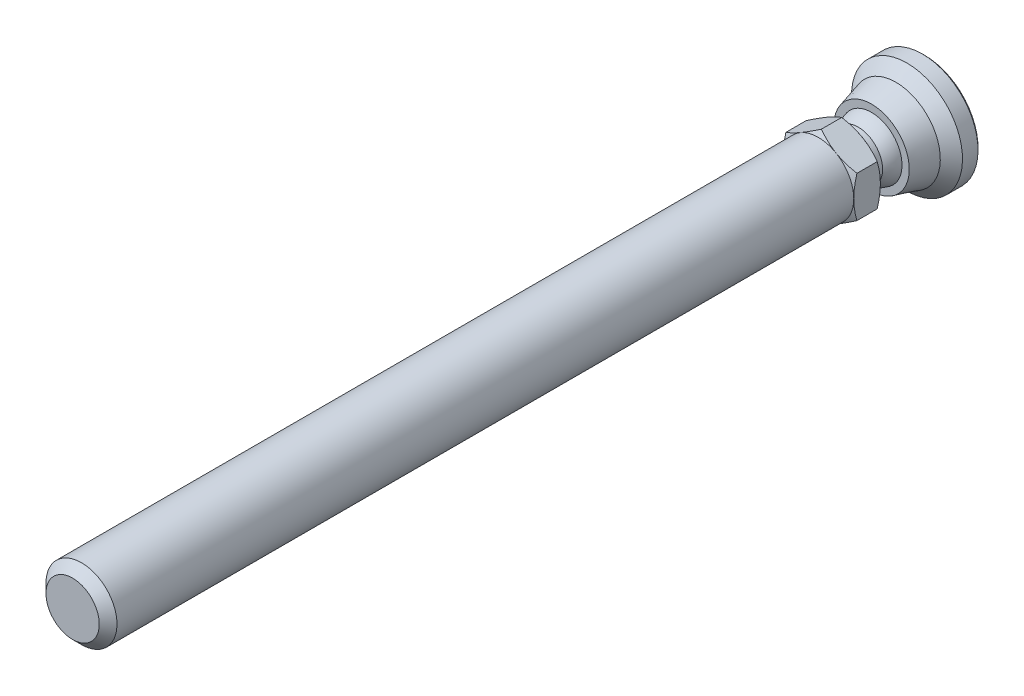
ISO-10303-21;
HEADER;
FILE_DESCRIPTION(('STEP AP214'),'2;1');
FILE_NAME('part.step','',(''),(''),'','','');
FILE_SCHEMA(('AUTOMOTIVE_DESIGN { 1 0 10303 214 1 1 1 1 }'));
ENDSEC;
DATA;
#1=APPLICATION_CONTEXT('core data for automotive mechanical design processes');
#2=APPLICATION_PROTOCOL_DEFINITION('international standard','automotive_design',2000,#1);
#3=PRODUCT_CONTEXT('',#1,'mechanical');
#4=PRODUCT('Part','Part','',(#3));
#5=PRODUCT_RELATED_PRODUCT_CATEGORY('part','',(#4));
#6=PRODUCT_DEFINITION_FORMATION('','',#4);
#7=PRODUCT_DEFINITION_CONTEXT('part definition',#1,'design');
#8=PRODUCT_DEFINITION('design','',#6,#7);
#9=PRODUCT_DEFINITION_SHAPE('','',#8);
#10=(LENGTH_UNIT() NAMED_UNIT(*) SI_UNIT(.MILLI.,.METRE.));
#11=(NAMED_UNIT(*) PLANE_ANGLE_UNIT() SI_UNIT($,.RADIAN.));
#12=(NAMED_UNIT(*) SI_UNIT($,.STERADIAN.) SOLID_ANGLE_UNIT());
#13=UNCERTAINTY_MEASURE_WITH_UNIT(LENGTH_MEASURE(1.E-05),#10,'distance_accuracy_value','');
#14=(GEOMETRIC_REPRESENTATION_CONTEXT(3) GLOBAL_UNCERTAINTY_ASSIGNED_CONTEXT((#13)) GLOBAL_UNIT_ASSIGNED_CONTEXT((#10,
#11,#12)) REPRESENTATION_CONTEXT('',''));
#15=CARTESIAN_POINT('',(0.,0.,0.));
#16=DIRECTION('',(0.,0.,1.));
#17=DIRECTION('',(1.,0.,0.));
#18=AXIS2_PLACEMENT_3D('',#15,#16,#17);
#19=CARTESIAN_POINT('',(-7.76470588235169,0.,17.9999999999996));
#20=DIRECTION('',(0.,0.,1.));
#21=DIRECTION('',(0.,-1.,0.));
#22=AXIS2_PLACEMENT_3D('',#19,#20,#21);
#23=PLANE('',#22);
#24=CARTESIAN_POINT('',(0.,0.,17.9999999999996));
#25=DIRECTION('',(0.,0.,-1.));
#26=DIRECTION('',(0.,1.,0.));
#27=AXIS2_PLACEMENT_3D('',#24,#25,#26);
#28=CIRCLE('',#27,5.49999999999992);
#29=CARTESIAN_POINT('',(0.,5.49999999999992,17.9999999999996));
#30=VERTEX_POINT('',#29);
#31=EDGE_CURVE('E289',#30,#30,#28,.T.);
#32=ORIENTED_EDGE('',*,*,#31,.F.);
#33=EDGE_LOOP('',(#32));
#34=FACE_BOUND('',#33,.T.);
#35=CARTESIAN_POINT('',(0.,0.,17.9999999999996));
#36=DIRECTION('',(0.,0.,1.));
#37=DIRECTION('',(0.,-1.,0.));
#38=AXIS2_PLACEMENT_3D('',#35,#36,#37);
#39=CIRCLE('',#38,7.99999999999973);
#40=CARTESIAN_POINT('',(-4.,-6.92820323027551,17.9999999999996));
#41=VERTEX_POINT('',#40);
#42=CARTESIAN_POINT('',(4.,-6.92820323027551,17.9999999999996));
#43=VERTEX_POINT('',#42);
#44=EDGE_CURVE('E106',#41,#43,#39,.T.);
#45=ORIENTED_EDGE('',*,*,#44,.F.);
#46=CARTESIAN_POINT('',(-8.,0.,17.9999999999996));
#47=VERTEX_POINT('',#46);
#48=EDGE_CURVE('E117',#47,#41,#39,.T.);
#49=ORIENTED_EDGE('',*,*,#48,.F.);
#50=CARTESIAN_POINT('',(-4.,6.92820323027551,17.9999999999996));
#51=VERTEX_POINT('',#50);
#52=EDGE_CURVE('E409',#51,#47,#39,.T.);
#53=ORIENTED_EDGE('',*,*,#52,.F.);
#54=CARTESIAN_POINT('',(4.,6.92820323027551,17.9999999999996));
#55=VERTEX_POINT('',#54);
#56=EDGE_CURVE('E34',#55,#51,#39,.T.);
#57=ORIENTED_EDGE('',*,*,#56,.F.);
#58=CARTESIAN_POINT('',(8.,0.,17.9999999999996));
#59=VERTEX_POINT('',#58);
#60=EDGE_CURVE('E140',#59,#55,#39,.T.);
#61=ORIENTED_EDGE('',*,*,#60,.F.);
#62=EDGE_CURVE('E119',#43,#59,#39,.T.);
#63=ORIENTED_EDGE('',*,*,#62,.F.);
#64=EDGE_LOOP('',(#45,#49,#53,#57,#61,#63));
#65=FACE_BOUND('',#64,.T.);
#66=ADVANCED_FACE('F14',(#34,#65),#23,.F.);
#67=CARTESIAN_POINT('',(0.,0.,0.));
#68=DIRECTION('',(0.,0.,-1.));
#69=DIRECTION('',(0.,1.,0.));
#70=AXIS2_PLACEMENT_3D('',#67,#68,#69);
#71=CYLINDRICAL_SURFACE('',#70,5.49999999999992);
#72=CARTESIAN_POINT('',(0.,0.,14.9999999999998));
#73=DIRECTION('',(0.,0.,-1.));
#74=DIRECTION('',(0.,1.,0.));
#75=AXIS2_PLACEMENT_3D('',#72,#73,#74);
#76=CIRCLE('',#75,5.49999999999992);
#77=CARTESIAN_POINT('',(-5.49999999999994,0.,14.9999999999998));
#78=VERTEX_POINT('',#77);
#79=EDGE_CURVE('E294',#78,#78,#76,.T.);
#80=ORIENTED_EDGE('',*,*,#79,.F.);
#81=EDGE_LOOP('',(#80));
#82=FACE_BOUND('',#81,.T.);
#83=ORIENTED_EDGE('',*,*,#31,.T.);
#84=EDGE_LOOP('',(#83));
#85=FACE_BOUND('',#84,.T.);
#86=ADVANCED_FACE('F255',(#82,#85),#71,.T.);
#87=CARTESIAN_POINT('',(0.,0.,10.6698729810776));
#88=DIRECTION('',(0.,0.,-1.));
#89=DIRECTION('',(-1.,0.,0.));
#90=AXIS2_PLACEMENT_3D('',#87,#88,#89);
#91=SPHERICAL_SURFACE('',#90,7.);
#92=CARTESIAN_POINT('',(0.,0.,11.9999999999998));
#93=DIRECTION('',(0.,0.,-1.));
#94=DIRECTION('',(0.,1.,0.));
#95=AXIS2_PLACEMENT_3D('',#92,#93,#94);
#96=CIRCLE('',#95,6.87246404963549);
#97=CARTESIAN_POINT('',(-6.87246404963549,0.,11.9999999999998));
#98=VERTEX_POINT('',#97);
#99=EDGE_CURVE('E297',#98,#98,#96,.T.);
#100=CARTESIAN_POINT('',(-6.87246404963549,0.,11.9999999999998));
#101=CARTESIAN_POINT('',(-6.86587210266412,0.,12.0340591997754));
#102=CARTESIAN_POINT('',(-6.85902692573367,0.,12.0680693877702));
#103=CARTESIAN_POINT('',(-6.84483171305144,0.,12.1359842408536));
#104=CARTESIAN_POINT('',(-6.83748167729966,0.,12.1698889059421));
#105=CARTESIAN_POINT('',(-6.82227834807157,0.,12.2375852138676));
#106=CARTESIAN_POINT('',(-6.81442505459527,0.,12.2713768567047));
#107=CARTESIAN_POINT('',(-6.79821695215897,0.,12.3388396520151));
#108=CARTESIAN_POINT('',(-6.78986214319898,0.,12.3725108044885));
#109=CARTESIAN_POINT('',(-6.77265285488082,0.,12.4397251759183));
#110=CARTESIAN_POINT('',(-6.76379837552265,0.,12.4732683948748));
#111=CARTESIAN_POINT('',(-6.74559170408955,0.,12.5402194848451));
#112=CARTESIAN_POINT('',(-6.73623951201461,0.,12.5736273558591));
#113=CARTESIAN_POINT('',(-6.71703948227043,0.,12.6403003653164));
#114=CARTESIAN_POINT('',(-6.70719164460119,0.,12.6735655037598));
#115=CARTESIAN_POINT('',(-6.6870025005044,0.,12.7399456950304));
#116=CARTESIAN_POINT('',(-6.67666119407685,0.,12.7730607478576));
#117=CARTESIAN_POINT('',(-6.65548739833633,0.,12.839133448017));
#118=CARTESIAN_POINT('',(-6.64465490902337,0.,12.8720910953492));
#119=CARTESIAN_POINT('',(-6.62250114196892,0.,12.9378416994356));
#120=CARTESIAN_POINT('',(-6.61117986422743,0.,12.9706346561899));
#121=CARTESIAN_POINT('',(-6.58805102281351,0.,13.0360486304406));
#122=CARTESIAN_POINT('',(-6.57624345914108,0.,13.0686696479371));
#123=CARTESIAN_POINT('',(-6.55214465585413,0.,13.133732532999));
#124=CARTESIAN_POINT('',(-6.53985341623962,0.,13.1661744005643));
#125=CARTESIAN_POINT('',(-6.51478997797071,0.,13.2308718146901));
#126=CARTESIAN_POINT('',(-6.50201777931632,0.,13.2631273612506));
#127=CARTESIAN_POINT('',(-6.47599524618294,0.,13.3274450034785));
#128=CARTESIAN_POINT('',(-6.46274491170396,0.,13.3595070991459));
#129=CARTESIAN_POINT('',(-6.43576903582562,0.,13.42343075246));
#130=CARTESIAN_POINT('',(-6.42204349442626,0.,13.4552923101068));
#131=CARTESIAN_POINT('',(-6.39412023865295,0.,13.5188078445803));
#132=CARTESIAN_POINT('',(-6.37992252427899,0.,13.5504618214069));
#133=CARTESIAN_POINT('',(-6.35105806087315,0.,13.6135551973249));
#134=CARTESIAN_POINT('',(-6.33639131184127,0.,13.6449945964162));
#135=CARTESIAN_POINT('',(-6.30659202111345,0.,13.7076518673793));
#136=CARTESIAN_POINT('',(-6.29145947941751,0.,13.7388697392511));
#137=CARTESIAN_POINT('',(-6.26073194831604,0.,13.8010770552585));
#138=CARTESIAN_POINT('',(-6.2451369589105,0.,13.832066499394));
#139=CARTESIAN_POINT('',(-6.21348797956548,0.,13.8938101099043));
#140=CARTESIAN_POINT('',(-6.197433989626,0.,13.9245642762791));
#141=CARTESIAN_POINT('',(-6.16487055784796,0.,13.9858305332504));
#142=CARTESIAN_POINT('',(-6.14836111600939,0.,14.0163426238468));
#143=CARTESIAN_POINT('',(-6.11489042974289,0.,14.077117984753));
#144=CARTESIAN_POINT('',(-6.09792918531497,0.,14.1073812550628));
#145=CARTESIAN_POINT('',(-6.06355864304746,0.,14.1676522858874));
#146=CARTESIAN_POINT('',(-6.04614934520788,0.,14.1976600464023));
#147=CARTESIAN_POINT('',(-6.01088654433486,0.,14.2574134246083));
#148=CARTESIAN_POINT('',(-5.99303304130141,0.,14.2871590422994));
#149=CARTESIAN_POINT('',(-5.95688577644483,0.,14.3463815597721));
#150=CARTESIAN_POINT('',(-5.93859201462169,0.,14.3758584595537));
#151=CARTESIAN_POINT('',(-5.90156827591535,0.,14.434537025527));
#152=CARTESIAN_POINT('',(-5.88283829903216,0.,14.4637386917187));
#153=CARTESIAN_POINT('',(-5.84494627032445,0.,14.5218603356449));
#154=CARTESIAN_POINT('',(-5.82578421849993,0.,14.5507803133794));
#155=CARTESIAN_POINT('',(-5.78703227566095,0.,14.608332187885));
#156=CARTESIAN_POINT('',(-5.76744238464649,0.,14.636964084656));
#157=CARTESIAN_POINT('',(-5.72783909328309,0.,14.6939334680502));
#158=CARTESIAN_POINT('',(-5.70782569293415,0.,14.7222709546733));
#159=CARTESIAN_POINT('',(-5.66737980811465,0.,14.7786452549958));
#160=CARTESIAN_POINT('',(-5.64694732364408,0.,14.8066820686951));
#161=CARTESIAN_POINT('',(-5.60566778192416,0.,14.8624488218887));
#162=CARTESIAN_POINT('',(-5.58482072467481,0.,14.890178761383));
#163=CARTESIAN_POINT('',(-5.5427166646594,0.,14.9453256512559));
#164=CARTESIAN_POINT('',(-5.52145966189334,0.,14.9727426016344));
#165=CARTESIAN_POINT('',(-5.49999999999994,0.,14.9999999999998));
#166=B_SPLINE_CURVE_WITH_KNOTS('',3,(#100,#101,#102,#103,#104,#105,#106,#107,#108,#109,#110,
#111,#112,#113,#114,#115,#116,#117,#118,#119,#120,#121,#122,#123,#124,#125,#126,#127,#128,#129,
#130,#131,#132,#133,#134,#135,#136,#137,#138,#139,#140,#141,#142,#143,#144,#145,#146,#147,#148,
#149,#150,#151,#152,#153,#154,#155,#156,#157,#158,#159,#160,#161,#162,#163,#164,#165),
.UNSPECIFIED.,.F.,.F.,(4,2,2,2,2,2,2,2,2,2,2,2,2,2,2,2,2,2,2,2,2,2,2,2,2,2,2,2,2,2,2,2,4),(0.,
0.104072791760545,0.208145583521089,0.312218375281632,0.416291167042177,0.520363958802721,
0.624436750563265,0.728509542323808,0.832582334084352,0.936655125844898,1.04072791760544,
1.14480070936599,1.24887350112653,1.35294629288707,1.45701908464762,1.56109187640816,
1.66516466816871,1.76923745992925,1.87331025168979,1.97738304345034,2.08145583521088,
2.18552862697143,2.28960141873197,2.39367421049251,2.49774700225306,2.6018197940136,
2.70589258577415,2.80996537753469,2.91403816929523,3.01811096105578,3.12218375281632,
3.22625654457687,3.33032933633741),.UNSPECIFIED.);
#167=EDGE_CURVE('BSEAM251',#98,#78,#166,.T.);
#168=ORIENTED_EDGE('',*,*,#99,.F.);
#169=ORIENTED_EDGE('',*,*,#79,.T.);
#170=ORIENTED_EDGE('',*,*,#167,.T.);
#171=ORIENTED_EDGE('',*,*,#167,.F.);
#172=EDGE_LOOP('',(#168,#170,#169,#171));
#173=FACE_BOUND('',#172,.T.);
#174=ADVANCED_FACE('F251',(#173),#91,.T.);
#175=CARTESIAN_POINT('',(-8.5,0.,11.9999999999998));
#176=DIRECTION('',(0.,0.,-1.));
#177=DIRECTION('',(0.,1.,0.));
#178=AXIS2_PLACEMENT_3D('',#175,#176,#177);
#179=PLANE('',#178);
#180=CARTESIAN_POINT('',(0.,0.,11.9999999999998));
#181=DIRECTION('',(0.,0.,-1.));
#182=DIRECTION('',(0.,1.,0.));
#183=AXIS2_PLACEMENT_3D('',#180,#181,#182);
#184=CIRCLE('',#183,8.5);
#185=CARTESIAN_POINT('',(0.,8.5,11.9999999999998));
#186=VERTEX_POINT('',#185);
#187=EDGE_CURVE('E300',#186,#186,#184,.T.);
#188=ORIENTED_EDGE('',*,*,#187,.F.);
#189=EDGE_LOOP('',(#188));
#190=FACE_BOUND('',#189,.T.);
#191=ORIENTED_EDGE('',*,*,#99,.T.);
#192=EDGE_LOOP('',(#191));
#193=FACE_BOUND('',#192,.T.);
#194=ADVANCED_FACE('F247',(#190,#193),#179,.F.);
#195=CARTESIAN_POINT('',(0.,0.,11.9999999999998));
#196=DIRECTION('',(0.,0.,-1.));
#197=DIRECTION('',(0.,1.,0.));
#198=AXIS2_PLACEMENT_3D('',#195,#196,#197);
#199=CONICAL_SURFACE('',#198,8.5,0.266252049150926);
#200=CARTESIAN_POINT('',(0.,0.,6.49999999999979));
#201=DIRECTION('',(0.,0.,-1.));
#202=DIRECTION('',(0.,1.,0.));
#203=AXIS2_PLACEMENT_3D('',#200,#201,#202);
#204=CIRCLE('',#203,10.);
#205=CARTESIAN_POINT('',(0.,10.,6.49999999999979));
#206=VERTEX_POINT('',#205);
#207=EDGE_CURVE('E303',#206,#206,#204,.T.);
#208=ORIENTED_EDGE('',*,*,#207,.F.);
#209=EDGE_LOOP('',(#208));
#210=FACE_BOUND('',#209,.T.);
#211=ORIENTED_EDGE('',*,*,#187,.T.);
#212=EDGE_LOOP('',(#211));
#213=FACE_BOUND('',#212,.T.);
#214=ADVANCED_FACE('F243',(#210,#213),#199,.T.);
#215=CARTESIAN_POINT('',(0.,0.,6.49999999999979));
#216=DIRECTION('',(0.,0.,-1.));
#217=DIRECTION('',(0.,1.,0.));
#218=AXIS2_PLACEMENT_3D('',#215,#216,#217);
#219=CONICAL_SURFACE('',#218,10.,0.785398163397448);
#220=CARTESIAN_POINT('',(0.,0.,3.99999999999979));
#221=DIRECTION('',(0.,0.,-1.));
#222=DIRECTION('',(0.,1.,0.));
#223=AXIS2_PLACEMENT_3D('',#220,#221,#222);
#224=CIRCLE('',#223,12.5);
#225=CARTESIAN_POINT('',(0.,12.5,3.99999999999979));
#226=VERTEX_POINT('',#225);
#227=EDGE_CURVE('E306',#226,#226,#224,.T.);
#228=ORIENTED_EDGE('',*,*,#227,.F.);
#229=EDGE_LOOP('',(#228));
#230=FACE_BOUND('',#229,.T.);
#231=ORIENTED_EDGE('',*,*,#207,.T.);
#232=EDGE_LOOP('',(#231));
#233=FACE_BOUND('',#232,.T.);
#234=ADVANCED_FACE('F239',(#230,#233),#219,.T.);
#235=CARTESIAN_POINT('',(0.,0.,0.));
#236=DIRECTION('',(0.,0.,-1.));
#237=DIRECTION('',(0.,1.,0.));
#238=AXIS2_PLACEMENT_3D('',#235,#236,#237);
#239=CYLINDRICAL_SURFACE('',#238,12.5);
#240=CARTESIAN_POINT('',(0.,0.,0.499999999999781));
#241=DIRECTION('',(0.,0.,-1.));
#242=DIRECTION('',(0.,1.,0.));
#243=AXIS2_PLACEMENT_3D('',#240,#241,#242);
#244=CIRCLE('',#243,12.5);
#245=CARTESIAN_POINT('',(0.,12.5,0.499999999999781));
#246=VERTEX_POINT('',#245);
#247=EDGE_CURVE('E309',#246,#246,#244,.T.);
#248=ORIENTED_EDGE('',*,*,#247,.F.);
#249=EDGE_LOOP('',(#248));
#250=FACE_BOUND('',#249,.T.);
#251=ORIENTED_EDGE('',*,*,#227,.T.);
#252=EDGE_LOOP('',(#251));
#253=FACE_BOUND('',#252,.T.);
#254=ADVANCED_FACE('F235',(#250,#253),#239,.T.);
#255=CARTESIAN_POINT('',(0.,0.,0.499999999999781));
#256=DIRECTION('',(0.,0.,1.));
#257=DIRECTION('',(0.,-1.,0.));
#258=AXIS2_PLACEMENT_3D('',#255,#256,#257);
#259=CONICAL_SURFACE('',#258,12.5,0.785398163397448);
#260=CARTESIAN_POINT('',(0.,0.,-2.19442519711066E-13));
#261=DIRECTION('',(0.,0.,-1.));
#262=DIRECTION('',(0.,1.,0.));
#263=AXIS2_PLACEMENT_3D('',#260,#261,#262);
#264=CIRCLE('',#263,12.);
#265=CARTESIAN_POINT('',(0.,12.,-2.19442519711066E-13));
#266=VERTEX_POINT('',#265);
#267=EDGE_CURVE('E312',#266,#266,#264,.T.);
#268=ORIENTED_EDGE('',*,*,#267,.F.);
#269=EDGE_LOOP('',(#268));
#270=FACE_BOUND('',#269,.T.);
#271=ORIENTED_EDGE('',*,*,#247,.T.);
#272=EDGE_LOOP('',(#271));
#273=FACE_BOUND('',#272,.T.);
#274=ADVANCED_FACE('F231',(#270,#273),#259,.T.);
#275=CARTESIAN_POINT('',(-12.,0.,-2.19442519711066E-13));
#276=DIRECTION('',(0.,0.,1.));
#277=DIRECTION('',(0.,-1.,0.));
#278=AXIS2_PLACEMENT_3D('',#275,#276,#277);
#279=PLANE('',#278);
#280=ORIENTED_EDGE('',*,*,#267,.T.);
#281=EDGE_LOOP('',(#280));
#282=FACE_BOUND('',#281,.T.);
#283=ADVANCED_FACE('F163',(#282),#279,.F.);
#284=CARTESIAN_POINT('',(0.,0.,17.9999999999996));
#285=DIRECTION('',(0.,0.,1.));
#286=DIRECTION('',(0.,-1.,0.));
#287=AXIS2_PLACEMENT_3D('',#284,#285,#286);
#288=CONICAL_SURFACE('',#287,7.99999999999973,1.0471975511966);
#289=CARTESIAN_POINT('',(8.,12.3566992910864,21.8799824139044));
#290=CARTESIAN_POINT('',(8.,12.0077080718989,21.7108919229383));
#291=CARTESIAN_POINT('',(8.,11.6579103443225,21.5434372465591));
#292=CARTESIAN_POINT('',(8.,10.9562727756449,21.2127205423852));
#293=CARTESIAN_POINT('',(8.,10.6044326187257,21.0494591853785));
#294=CARTESIAN_POINT('',(8.,9.89644415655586,20.7272180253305));
#295=CARTESIAN_POINT('',(8.,9.54028279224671,20.56826681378));
#296=CARTESIAN_POINT('',(8.,8.82510984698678,20.2569361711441));
#297=CARTESIAN_POINT('',(8.,8.4660984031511,20.1045564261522));
#298=CARTESIAN_POINT('',(8.,7.73324882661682,19.8034188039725));
#299=CARTESIAN_POINT('',(8.,7.35930058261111,19.6549273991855));
#300=CARTESIAN_POINT('',(8.,6.60701160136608,19.369304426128));
#301=CARTESIAN_POINT('',(8.,6.22867037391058,19.2321741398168));
#302=CARTESIAN_POINT('',(8.,5.46771343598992,18.9729105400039));
#303=CARTESIAN_POINT('',(8.,5.08510833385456,18.8507464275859));
#304=CARTESIAN_POINT('',(8.,4.3144241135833,18.6253664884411));
#305=CARTESIAN_POINT('',(8.,3.92634677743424,18.5221446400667));
#306=CARTESIAN_POINT('',(8.,3.14658338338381,18.3401905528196));
#307=CARTESIAN_POINT('',(8.,2.75492881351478,18.2613270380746));
#308=CARTESIAN_POINT('',(8.,2.16392068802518,18.1647382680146));
#309=CARTESIAN_POINT('',(8.,1.96631533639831,18.136158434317));
#310=CARTESIAN_POINT('',(8.,1.57013952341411,18.086795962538));
#311=CARTESIAN_POINT('',(8.,1.37156915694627,18.0660125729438));
#312=CARTESIAN_POINT('',(8.,0.976300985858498,18.032915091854));
#313=CARTESIAN_POINT('',(8.,0.779612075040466,18.020495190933));
#314=CARTESIAN_POINT('',(8.,0.385885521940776,18.0039806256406));
#315=CARTESIAN_POINT('',(8.,0.188847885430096,17.999885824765));
#316=CARTESIAN_POINT('',(8.,-0.205224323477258,18.0001190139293));
#317=CARTESIAN_POINT('',(8.,-0.402258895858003,18.0044470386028));
#318=CARTESIAN_POINT('',(8.,-0.795972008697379,18.0214209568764));
#319=CARTESIAN_POINT('',(8.,-0.992650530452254,18.0340672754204));
#320=CARTESIAN_POINT('',(8.,-1.46686643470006,18.0743216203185));
#321=CARTESIAN_POINT('',(8.,-1.74406860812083,18.105961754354));
#322=CARTESIAN_POINT('',(8.,-2.29636942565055,18.1840278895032));
#323=CARTESIAN_POINT('',(8.,-2.5714677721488,18.2304559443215));
#324=CARTESIAN_POINT('',(8.,-3.39331934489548,18.3894561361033));
#325=CARTESIAN_POINT('',(8.,-3.93631189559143,18.5217138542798));
#326=CARTESIAN_POINT('',(8.,-4.74814032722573,18.7504739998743));
#327=CARTESIAN_POINT('',(8.,-5.02120221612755,18.8328367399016));
#328=CARTESIAN_POINT('',(8.,-5.56467297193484,19.0059716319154));
#329=CARTESIAN_POINT('',(8.,-5.83508182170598,19.0967438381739));
#330=CARTESIAN_POINT('',(8.,-6.37333413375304,19.2852533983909));
#331=CARTESIAN_POINT('',(8.,-6.64117844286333,19.3829883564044));
#332=CARTESIAN_POINT('',(8.,-7.17465798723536,19.584288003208));
#333=CARTESIAN_POINT('',(8.,-7.44029324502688,19.6878526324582));
#334=CARTESIAN_POINT('',(8.,-8.05305589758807,19.9332653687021));
#335=CARTESIAN_POINT('',(8.,-8.39947083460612,20.0768887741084));
#336=CARTESIAN_POINT('',(8.,-9.08946418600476,20.3708134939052));
#337=CARTESIAN_POINT('',(8.,-9.43304244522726,20.5211151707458));
#338=CARTESIAN_POINT('',(8.,-10.1178651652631,20.827095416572));
#339=CARTESIAN_POINT('',(8.,-10.4591091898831,20.9827749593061));
#340=CARTESIAN_POINT('',(8.,-11.1395903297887,21.2984675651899));
#341=CARTESIAN_POINT('',(8.,-11.4788274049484,21.4584807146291));
#342=CARTESIAN_POINT('',(8.,-12.1559424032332,21.7822072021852));
#343=CARTESIAN_POINT('',(8.,-12.4938186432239,21.9459240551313));
#344=CARTESIAN_POINT('',(8.,-13.1681353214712,22.2762910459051));
#345=CARTESIAN_POINT('',(8.,-13.5045757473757,22.4429412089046));
#346=CARTESIAN_POINT('',(8.,-14.5119956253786,22.946491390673));
#347=CARTESIAN_POINT('',(8.,-15.1811558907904,23.2870307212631));
#348=CARTESIAN_POINT('',(8.,-16.4622375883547,23.9473269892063));
#349=CARTESIAN_POINT('',(8.,-17.0744340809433,24.2665525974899));
#350=CARTESIAN_POINT('',(8.,-18.2965283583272,24.9094177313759));
#351=CARTESIAN_POINT('',(7.99999999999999,-18.9064260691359,25.233057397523));
#352=CARTESIAN_POINT('',(7.99999999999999,-20.1229932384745,25.8829524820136));
#353=CARTESIAN_POINT('',(7.99999999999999,-20.7296669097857,26.2092000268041));
#354=CARTESIAN_POINT('',(7.99999999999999,-21.9415356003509,26.8643563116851));
#355=CARTESIAN_POINT('',(8.,-22.5467306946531,27.1932649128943));
#356=CARTESIAN_POINT('',(8.,-23.1513774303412,27.523171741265));
#357=B_SPLINE_CURVE_WITH_KNOTS('',3,(#289,#290,#291,#292,#293,#294,#295,#296,#297,#298,#299,
#300,#301,#302,#303,#304,#305,#306,#307,#308,#309,#310,#311,#312,#313,#314,#315,#316,#317,#318,
#319,#320,#321,#322,#323,#324,#325,#326,#327,#328,#329,#330,#331,#332,#333,#334,#335,#336,#337,
#338,#339,#340,#341,#342,#343,#344,#345,#346,#347,#348,#349,#350,#351,#352,#353,#354,#355,#356),
.UNSPECIFIED.,.F.,.F.,(4,2,2,2,2,2,2,2,2,2,2,2,2,2,2,2,2,2,2,2,2,2,2,2,2,2,2,2,2,2,2,2,2,4),(0.,
1.1634052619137,2.32699548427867,3.49700541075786,4.66695938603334,5.87387163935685,
7.08091989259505,8.28544087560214,9.48957828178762,10.6871081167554,11.2859627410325,
11.8847596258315,12.4758309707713,13.066892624,13.6579567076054,14.2490509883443,
15.0855833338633,15.9222319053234,17.5964807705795,18.4520500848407,19.3076249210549,
20.1629067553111,21.0181798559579,22.1431110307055,23.2681033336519,24.3933004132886,
25.518519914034,26.6448561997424,27.771202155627,30.0236203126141,32.094882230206,
34.1662102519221,36.2327011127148,38.2990848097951),.UNSPECIFIED.);
#358=CARTESIAN_POINT('',(8.,4.61880215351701,18.714531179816));
#359=VERTEX_POINT('',#358);
#360=EDGE_CURVE('E141',#359,#59,#357,.T.);
#361=ORIENTED_EDGE('',*,*,#360,.T.);
#362=ORIENTED_EDGE('',*,*,#60,.T.);
#363=CARTESIAN_POINT('',(-0.000199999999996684,9.23771977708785,18.7145978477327));
#364=CARTESIAN_POINT('',(0.175648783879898,9.13619343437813,18.655990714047));
#365=CARTESIAN_POINT('',(0.352153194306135,9.03428856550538,18.600043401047));
#366=CARTESIAN_POINT('',(0.70659546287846,8.82965122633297,18.4942010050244));
#367=CARTESIAN_POINT('',(0.884533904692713,8.72691841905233,18.4443085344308));
#368=CARTESIAN_POINT('',(1.42119823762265,8.41707512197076,18.3046927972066));
#369=CARTESIAN_POINT('',(1.78204258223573,8.20874154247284,18.2252811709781));
#370=CARTESIAN_POINT('',(2.32203917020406,7.89697436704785,18.1321616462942));
#371=CARTESIAN_POINT('',(2.49957818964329,7.79447216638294,18.1056345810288));
#372=CARTESIAN_POINT('',(2.8554591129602,7.58900421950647,18.0611531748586));
#373=CARTESIAN_POINT('',(3.03380094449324,7.4860385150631,18.0431980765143));
#374=CARTESIAN_POINT('',(3.3907916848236,7.27992981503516,18.0163156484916));
#375=CARTESIAN_POINT('',(3.56944001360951,7.17678715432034,18.0073780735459));
#376=CARTESIAN_POINT('',(3.92690170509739,6.97040655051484,17.9987223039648));
#377=CARTESIAN_POINT('',(4.10571506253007,6.86716861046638,17.9990038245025));
#378=CARTESIAN_POINT('',(4.44001336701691,6.67416139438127,18.0081450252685));
#379=CARTESIAN_POINT('',(4.59552190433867,6.58437849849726,18.0158896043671));
#380=CARTESIAN_POINT('',(4.90617476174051,6.40502298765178,18.0382011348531));
#381=CARTESIAN_POINT('',(5.06131905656,6.31545038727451,18.0527685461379));
#382=CARTESIAN_POINT('',(5.52615131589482,6.04707935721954,18.1063606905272));
#383=CARTESIAN_POINT('',(5.83501648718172,5.86875596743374,18.1552686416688));
#384=CARTESIAN_POINT('',(6.4560232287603,5.51021755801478,18.277539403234));
#385=CARTESIAN_POINT('',(6.76808554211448,5.33004829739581,18.3514205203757));
#386=CARTESIAN_POINT('',(7.38755648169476,4.97239658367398,18.5191001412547));
#387=CARTESIAN_POINT('',(7.69497304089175,4.79490955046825,18.6128592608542));
#388=CARTESIAN_POINT('',(8.0002,4.61868668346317,18.7145978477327));
#389=B_SPLINE_CURVE_WITH_KNOTS('',3,(#363,#364,#365,#366,#367,#368,#369,#370,#371,#372,#373,
#374,#375,#376,#377,#378,#379,#380,#381,#382,#383,#384,#385,#386,#387,#388),.UNSPECIFIED.,.F.,
.F.,(4,2,2,2,2,2,2,2,2,2,2,2,4),(0.,0.633973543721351,1.26821965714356,2.53934712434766,
3.15934343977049,3.77928496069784,4.39852133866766,5.01773858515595,5.55680239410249,
6.09590254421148,7.17487077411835,8.27776850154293,9.37850115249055),.UNSPECIFIED.);
#390=EDGE_CURVE('E18',#55,#359,#389,.T.);
#391=ORIENTED_EDGE('',*,*,#390,.T.);
#392=EDGE_LOOP('',(#361,#362,#391));
#393=FACE_BOUND('',#392,.T.);
#394=ADVANCED_FACE('F158',(#393),#288,.T.);
#395=CARTESIAN_POINT('',(-8.0002,4.61868668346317,18.7145978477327));
#396=CARTESIAN_POINT('',(-7.82435121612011,4.7202130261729,18.655990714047));
#397=CARTESIAN_POINT('',(-7.64784680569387,4.82211789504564,18.600043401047));
#398=CARTESIAN_POINT('',(-7.29340453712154,5.02675523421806,18.4942010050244));
#399=CARTESIAN_POINT('',(-7.11546609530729,5.1294880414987,18.4443085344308));
#400=CARTESIAN_POINT('',(-6.57880176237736,5.43933133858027,18.3046927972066));
#401=CARTESIAN_POINT('',(-6.21795741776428,5.64766491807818,18.2252811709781));
#402=CARTESIAN_POINT('',(-5.67796082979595,5.95943209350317,18.1321616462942));
#403=CARTESIAN_POINT('',(-5.50042181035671,6.06193429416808,18.1056345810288));
#404=CARTESIAN_POINT('',(-5.1445408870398,6.26740224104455,18.0611531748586));
#405=CARTESIAN_POINT('',(-4.96619905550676,6.37036794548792,18.0431980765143));
#406=CARTESIAN_POINT('',(-4.6092083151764,6.57647664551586,18.0163156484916));
#407=CARTESIAN_POINT('',(-4.4305599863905,6.67961930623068,18.0073780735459));
#408=CARTESIAN_POINT('',(-4.07309829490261,6.88599991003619,17.9987223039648));
#409=CARTESIAN_POINT('',(-3.89428493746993,6.98923785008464,17.9990038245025));
#410=CARTESIAN_POINT('',(-3.55998663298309,7.18224506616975,18.0081450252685));
#411=CARTESIAN_POINT('',(-3.40447809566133,7.27202796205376,18.0158896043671));
#412=CARTESIAN_POINT('',(-3.09382523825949,7.45138347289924,18.0382011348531));
#413=CARTESIAN_POINT('',(-2.93868094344,7.54095607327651,18.0527685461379));
#414=CARTESIAN_POINT('',(-2.47384868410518,7.80932710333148,18.1063606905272));
#415=CARTESIAN_POINT('',(-2.16498351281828,7.98765049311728,18.1552686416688));
#416=CARTESIAN_POINT('',(-1.5439767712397,8.34618890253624,18.277539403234));
#417=CARTESIAN_POINT('',(-1.23191445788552,8.52635816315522,18.3514205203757));
#418=CARTESIAN_POINT('',(-0.612443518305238,8.88400987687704,18.5191001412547));
#419=CARTESIAN_POINT('',(-0.305026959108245,9.06149691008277,18.6128592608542));
#420=CARTESIAN_POINT('',(0.000200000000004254,9.23771977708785,18.7145978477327));
#421=B_SPLINE_CURVE_WITH_KNOTS('',3,(#395,#396,#397,#398,#399,#400,#401,#402,#403,#404,#405,
#406,#407,#408,#409,#410,#411,#412,#413,#414,#415,#416,#417,#418,#419,#420),.UNSPECIFIED.,.F.,
.F.,(4,2,2,2,2,2,2,2,2,2,2,2,4),(0.,0.633973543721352,1.26821965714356,2.53934712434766,
3.1593434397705,3.77928496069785,4.39852133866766,5.01773858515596,5.55680239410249,
6.09590254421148,7.17487077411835,8.27776850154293,9.37850115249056),.UNSPECIFIED.);
#422=CARTESIAN_POINT('',(0.,9.23760430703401,18.714531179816));
#423=VERTEX_POINT('',#422);
#424=EDGE_CURVE('E142',#51,#423,#421,.T.);
#425=ORIENTED_EDGE('',*,*,#424,.T.);
#426=EDGE_CURVE('E9',#423,#55,#389,.T.);
#427=ORIENTED_EDGE('',*,*,#426,.T.);
#428=ORIENTED_EDGE('',*,*,#56,.T.);
#429=EDGE_LOOP('',(#425,#427,#428));
#430=FACE_BOUND('',#429,.T.);
#431=ADVANCED_FACE('F162',(#430),#288,.T.);
#432=CARTESIAN_POINT('',(8.0002,-4.61868668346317,18.7145978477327));
#433=CARTESIAN_POINT('',(7.82435121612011,-4.7202130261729,18.655990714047));
#434=CARTESIAN_POINT('',(7.64784680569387,-4.82211789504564,18.600043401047));
#435=CARTESIAN_POINT('',(7.29340453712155,-5.02675523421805,18.4942010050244));
#436=CARTESIAN_POINT('',(7.11546609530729,-5.1294880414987,18.4443085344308));
#437=CARTESIAN_POINT('',(6.57880176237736,-5.43933133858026,18.3046927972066));
#438=CARTESIAN_POINT('',(6.21795741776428,-5.64766491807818,18.2252811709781));
#439=CARTESIAN_POINT('',(5.67796082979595,-5.95943209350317,18.1321616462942));
#440=CARTESIAN_POINT('',(5.50042181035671,-6.06193429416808,18.1056345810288));
#441=CARTESIAN_POINT('',(5.1445408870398,-6.26740224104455,18.0611531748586));
#442=CARTESIAN_POINT('',(4.96619905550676,-6.37036794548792,18.0431980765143));
#443=CARTESIAN_POINT('',(4.6092083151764,-6.57647664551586,18.0163156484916));
#444=CARTESIAN_POINT('',(4.4305599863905,-6.67961930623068,18.0073780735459));
#445=CARTESIAN_POINT('',(4.07309829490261,-6.88599991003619,17.9987223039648));
#446=CARTESIAN_POINT('',(3.89428493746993,-6.98923785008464,17.9990038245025));
#447=CARTESIAN_POINT('',(3.55998663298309,-7.18224506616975,18.0081450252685));
#448=CARTESIAN_POINT('',(3.40447809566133,-7.27202796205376,18.0158896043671));
#449=CARTESIAN_POINT('',(3.09382523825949,-7.45138347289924,18.0382011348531));
#450=CARTESIAN_POINT('',(2.93868094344,-7.54095607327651,18.0527685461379));
#451=CARTESIAN_POINT('',(2.47384868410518,-7.80932710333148,18.1063606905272));
#452=CARTESIAN_POINT('',(2.16498351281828,-7.98765049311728,18.1552686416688));
#453=CARTESIAN_POINT('',(1.5439767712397,-8.34618890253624,18.277539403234));
#454=CARTESIAN_POINT('',(1.23191445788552,-8.52635816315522,18.3514205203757));
#455=CARTESIAN_POINT('',(0.61244351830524,-8.88400987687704,18.5191001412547));
#456=CARTESIAN_POINT('',(0.305026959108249,-9.06149691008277,18.6128592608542));
#457=CARTESIAN_POINT('',(-0.000200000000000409,-9.23771977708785,18.7145978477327));
#458=B_SPLINE_CURVE_WITH_KNOTS('',3,(#432,#433,#434,#435,#436,#437,#438,#439,#440,#441,#442,
#443,#444,#445,#446,#447,#448,#449,#450,#451,#452,#453,#454,#455,#456,#457),.UNSPECIFIED.,.F.,
.F.,(4,2,2,2,2,2,2,2,2,2,2,2,4),(0.,0.633973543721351,1.26821965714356,2.53934712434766,
3.1593434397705,3.77928496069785,4.39852133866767,5.01773858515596,5.55680239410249,
6.09590254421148,7.17487077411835,8.27776850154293,9.37850115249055),.UNSPECIFIED.);
#459=CARTESIAN_POINT('',(8.,-4.61880215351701,18.714531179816));
#460=VERTEX_POINT('',#459);
#461=EDGE_CURVE('E122',#460,#43,#458,.T.);
#462=ORIENTED_EDGE('',*,*,#461,.T.);
#463=ORIENTED_EDGE('',*,*,#62,.T.);
#464=EDGE_CURVE('E126',#59,#460,#357,.T.);
#465=ORIENTED_EDGE('',*,*,#464,.T.);
#466=EDGE_LOOP('',(#462,#463,#465));
#467=FACE_BOUND('',#466,.T.);
#468=ADVANCED_FACE('F123',(#467),#288,.T.);
#469=CARTESIAN_POINT('',(0.000200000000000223,-9.23771977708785,18.7145978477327));
#470=CARTESIAN_POINT('',(-0.175648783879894,-9.13619343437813,18.655990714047));
#471=CARTESIAN_POINT('',(-0.352153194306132,-9.03428856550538,18.600043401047));
#472=CARTESIAN_POINT('',(-0.706595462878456,-8.82965122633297,18.4942010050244));
#473=CARTESIAN_POINT('',(-0.884533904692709,-8.72691841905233,18.4443085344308));
#474=CARTESIAN_POINT('',(-1.42119823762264,-8.41707512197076,18.3046927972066));
#475=CARTESIAN_POINT('',(-1.78204258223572,-8.20874154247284,18.2252811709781));
#476=CARTESIAN_POINT('',(-2.32203917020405,-7.89697436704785,18.1321616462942));
#477=CARTESIAN_POINT('',(-2.49957818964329,-7.79447216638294,18.1056345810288));
#478=CARTESIAN_POINT('',(-2.8554591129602,-7.58900421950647,18.0611531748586));
#479=CARTESIAN_POINT('',(-3.03380094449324,-7.4860385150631,18.0431980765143));
#480=CARTESIAN_POINT('',(-3.39079168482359,-7.27992981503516,18.0163156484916));
#481=CARTESIAN_POINT('',(-3.5694400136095,-7.17678715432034,18.0073780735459));
#482=CARTESIAN_POINT('',(-3.92690170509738,-6.97040655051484,17.9987223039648));
#483=CARTESIAN_POINT('',(-4.10571506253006,-6.86716861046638,17.9990038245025));
#484=CARTESIAN_POINT('',(-4.4400133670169,-6.67416139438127,18.0081450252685));
#485=CARTESIAN_POINT('',(-4.59552190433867,-6.58437849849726,18.0158896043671));
#486=CARTESIAN_POINT('',(-4.90617476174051,-6.40502298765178,18.0382011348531));
#487=CARTESIAN_POINT('',(-5.06131905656,-6.31545038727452,18.0527685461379));
#488=CARTESIAN_POINT('',(-5.52615131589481,-6.04707935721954,18.1063606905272));
#489=CARTESIAN_POINT('',(-5.83501648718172,-5.86875596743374,18.1552686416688));
#490=CARTESIAN_POINT('',(-6.4560232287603,-5.51021755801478,18.277539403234));
#491=CARTESIAN_POINT('',(-6.76808554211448,-5.3300482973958,18.3514205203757));
#492=CARTESIAN_POINT('',(-7.38755648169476,-4.97239658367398,18.5191001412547));
#493=CARTESIAN_POINT('',(-7.69497304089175,-4.79490955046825,18.6128592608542));
#494=CARTESIAN_POINT('',(-8.0002,-4.61868668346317,18.7145978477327));
#495=B_SPLINE_CURVE_WITH_KNOTS('',3,(#469,#470,#471,#472,#473,#474,#475,#476,#477,#478,#479,
#480,#481,#482,#483,#484,#485,#486,#487,#488,#489,#490,#491,#492,#493,#494),.UNSPECIFIED.,.F.,
.F.,(4,2,2,2,2,2,2,2,2,2,2,2,4),(0.,0.633973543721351,1.26821965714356,2.53934712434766,
3.15934343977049,3.77928496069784,4.39852133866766,5.01773858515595,5.55680239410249,
6.09590254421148,7.17487077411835,8.27776850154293,9.37850115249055),.UNSPECIFIED.);
#496=CARTESIAN_POINT('',(0.,-9.23760430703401,18.714531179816));
#497=VERTEX_POINT('',#496);
#498=EDGE_CURVE('E112',#497,#41,#495,.T.);
#499=ORIENTED_EDGE('',*,*,#498,.T.);
#500=ORIENTED_EDGE('',*,*,#44,.T.);
#501=EDGE_CURVE('E110',#43,#497,#458,.T.);
#502=ORIENTED_EDGE('',*,*,#501,.T.);
#503=EDGE_LOOP('',(#499,#500,#502));
#504=FACE_BOUND('',#503,.T.);
#505=ADVANCED_FACE('F108',(#504),#288,.T.);
#506=CARTESIAN_POINT('',(-8.,-4.618802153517,18.714531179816));
#507=VERTEX_POINT('',#506);
#508=EDGE_CURVE('E137',#41,#507,#495,.T.);
#509=ORIENTED_EDGE('',*,*,#508,.T.);
#510=CARTESIAN_POINT('',(-8.,12.3566992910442,21.8799824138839));
#511=CARTESIAN_POINT('',(-8.,12.0077080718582,21.7108919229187));
#512=CARTESIAN_POINT('',(-8.,11.6579103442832,21.5434372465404));
#513=CARTESIAN_POINT('',(-8.,10.9562727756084,21.2127205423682));
#514=CARTESIAN_POINT('',(-8.,10.6044326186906,21.0494591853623));
#515=CARTESIAN_POINT('',(-8.,9.89644415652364,20.727218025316));
#516=CARTESIAN_POINT('',(-8.,9.54028279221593,20.5682668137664));
#517=CARTESIAN_POINT('',(-8.,8.82510984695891,20.2569361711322));
#518=CARTESIAN_POINT('',(-8.,8.46609840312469,20.1045564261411));
#519=CARTESIAN_POINT('',(-8.,7.73324882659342,19.8034188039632));
#520=CARTESIAN_POINT('',(-8.,7.35930058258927,19.654927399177));
#521=CARTESIAN_POINT('',(-8.,6.60701160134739,19.3693044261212));
#522=CARTESIAN_POINT('',(-8.,6.22867037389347,19.2321741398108));
#523=CARTESIAN_POINT('',(-8.,5.46771343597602,18.9729105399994));
#524=CARTESIAN_POINT('',(-8.,5.08510833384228,18.8507464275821));
#525=CARTESIAN_POINT('',(-8.,4.31442411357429,18.6253664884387));
#526=CARTESIAN_POINT('',(-8.,3.92634677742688,18.5221446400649));
#527=CARTESIAN_POINT('',(-8.,3.14658338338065,18.340190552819));
#528=CARTESIAN_POINT('',(-8.,2.75492881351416,18.2613270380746));
#529=CARTESIAN_POINT('',(-8.,2.16392068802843,18.1647382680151));
#530=CARTESIAN_POINT('',(-8.,1.96631533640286,18.1361584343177));
#531=CARTESIAN_POINT('',(-8.,1.57013952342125,18.0867959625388));
#532=CARTESIAN_POINT('',(-8.,1.37156915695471,18.0660125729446));
#533=CARTESIAN_POINT('',(-8.,0.976300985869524,18.0329150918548));
#534=CARTESIAN_POINT('',(-8.,0.77961207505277,18.0204951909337));
#535=CARTESIAN_POINT('',(-8.,0.385885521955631,18.0039806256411));
#536=CARTESIAN_POINT('',(-8.,0.188847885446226,17.9998858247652));
#537=CARTESIAN_POINT('',(-8.,-0.20522432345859,18.000119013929));
#538=CARTESIAN_POINT('',(-8.,-0.40225889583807,18.0044470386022));
#539=CARTESIAN_POINT('',(-8.,-0.795972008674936,18.0214209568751));
#540=CARTESIAN_POINT('',(-8.,-0.992650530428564,18.0340672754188));
#541=CARTESIAN_POINT('',(-8.,-1.4668664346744,18.0743216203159));
#542=CARTESIAN_POINT('',(-8.,-1.74406860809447,18.1059617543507));
#543=CARTESIAN_POINT('',(-8.,-2.29636942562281,18.1840278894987));
#544=CARTESIAN_POINT('',(-8.,-2.57146777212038,18.2304559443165));
#545=CARTESIAN_POINT('',(-8.,-3.39331934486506,18.3894561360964));
#546=CARTESIAN_POINT('',(-8.,-3.93631189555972,18.5217138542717));
#547=CARTESIAN_POINT('',(-8.,-4.74814032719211,18.7504739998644));
#548=CARTESIAN_POINT('',(-8.,-5.02120221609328,18.832836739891));
#549=CARTESIAN_POINT('',(-8.,-5.56467297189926,19.0059716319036));
#550=CARTESIAN_POINT('',(-8.,-5.83508182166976,19.0967438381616));
#551=CARTESIAN_POINT('',(-8.,-6.37333413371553,19.2852533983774));
#552=CARTESIAN_POINT('',(-8.,-6.64117844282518,19.3829883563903));
#553=CARTESIAN_POINT('',(-8.,-7.17465798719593,19.5842880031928));
#554=CARTESIAN_POINT('',(-8.,-7.4402932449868,19.6878526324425));
#555=CARTESIAN_POINT('',(-8.,-8.05305589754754,19.9332653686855));
#556=CARTESIAN_POINT('',(-8.,-8.39947083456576,20.0768887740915));
#557=CARTESIAN_POINT('',(-8.,-9.08946418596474,20.3708134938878));
#558=CARTESIAN_POINT('',(-8.,-9.43304244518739,20.5211151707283));
#559=CARTESIAN_POINT('',(-8.,-10.1178651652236,20.827095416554));
#560=CARTESIAN_POINT('',(-8.,-10.4591091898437,20.982774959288));
#561=CARTESIAN_POINT('',(-8.,-11.1395903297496,21.2984675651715));
#562=CARTESIAN_POINT('',(-8.,-11.4788274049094,21.4584807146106));
#563=CARTESIAN_POINT('',(-8.,-12.1559424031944,21.7822072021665));
#564=CARTESIAN_POINT('',(-8.,-12.4938186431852,21.9459240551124));
#565=CARTESIAN_POINT('',(-8.,-13.1681353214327,22.2762910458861));
#566=CARTESIAN_POINT('',(-8.,-13.5045757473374,22.4429412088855));
#567=CARTESIAN_POINT('',(-8.,-14.5119956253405,22.9464913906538));
#568=CARTESIAN_POINT('',(-8.,-15.1811558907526,23.2870307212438));
#569=CARTESIAN_POINT('',(-8.,-16.4622375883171,23.9473269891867));
#570=CARTESIAN_POINT('',(-8.,-17.0744340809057,24.2665525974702));
#571=CARTESIAN_POINT('',(-8.,-18.2965283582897,24.9094177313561));
#572=CARTESIAN_POINT('',(-8.,-18.9064260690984,25.233057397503));
#573=CARTESIAN_POINT('',(-8.,-20.1229932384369,25.8829524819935));
#574=CARTESIAN_POINT('',(-8.,-20.7296669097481,26.2092000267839));
#575=CARTESIAN_POINT('',(-8.,-21.9415356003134,26.8643563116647));
#576=CARTESIAN_POINT('',(-8.,-22.5467306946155,27.1932649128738));
#577=CARTESIAN_POINT('',(-8.,-23.1513774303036,27.5231717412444));
#578=B_SPLINE_CURVE_WITH_KNOTS('',3,(#510,#511,#512,#513,#514,#515,#516,#517,#518,#519,#520,
#521,#522,#523,#524,#525,#526,#527,#528,#529,#530,#531,#532,#533,#534,#535,#536,#537,#538,#539,
#540,#541,#542,#543,#544,#545,#546,#547,#548,#549,#550,#551,#552,#553,#554,#555,#556,#557,#558,
#559,#560,#561,#562,#563,#564,#565,#566,#567,#568,#569,#570,#571,#572,#573,#574,#575,#576,#577),
.UNSPECIFIED.,.F.,.F.,(4,2,2,2,2,2,2,2,2,2,2,2,2,2,2,2,2,2,2,2,2,2,2,2,2,2,2,2,2,2,2,2,2,4),(0.,
1.16340526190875,2.32699548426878,3.49700541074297,4.66695938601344,5.87387163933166,
7.08091989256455,8.28544087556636,9.48957828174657,10.6871081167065,11.2859627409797,
11.8847596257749,12.4758309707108,13.0668926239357,13.6579567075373,14.2490509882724,
15.0855833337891,15.9222319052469,17.5964807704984,18.4520500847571,19.3076249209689,
20.1629067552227,21.0181798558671,22.143111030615,23.2681033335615,24.3933004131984,
25.518519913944,26.6448561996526,27.7712021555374,30.0236203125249,32.0948822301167,
34.1662102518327,36.2327011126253,38.2990848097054),.UNSPECIFIED.);
#579=EDGE_CURVE('E138',#507,#47,#578,.F.);
#580=ORIENTED_EDGE('',*,*,#579,.T.);
#581=ORIENTED_EDGE('',*,*,#48,.T.);
#582=EDGE_LOOP('',(#509,#580,#581));
#583=FACE_BOUND('',#582,.T.);
#584=ADVANCED_FACE('F408',(#583),#288,.T.);
#585=CARTESIAN_POINT('',(-8.,4.61880215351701,18.714531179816));
#586=VERTEX_POINT('',#585);
#587=EDGE_CURVE('E130',#47,#586,#578,.F.);
#588=ORIENTED_EDGE('',*,*,#587,.T.);
#589=EDGE_CURVE('E338',#586,#51,#421,.T.);
#590=ORIENTED_EDGE('',*,*,#589,.T.);
#591=ORIENTED_EDGE('',*,*,#52,.T.);
#592=EDGE_LOOP('',(#588,#590,#591));
#593=FACE_BOUND('',#592,.T.);
#594=ADVANCED_FACE('F275',(#593),#288,.T.);
#595=CARTESIAN_POINT('',(-5.99999999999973,0.,192.));
#596=DIRECTION('',(0.,0.,-1.));
#597=DIRECTION('',(0.,1.,0.));
#598=AXIS2_PLACEMENT_3D('',#595,#596,#597);
#599=PLANE('',#598);
#600=CARTESIAN_POINT('',(0.,0.,192.));
#601=DIRECTION('',(0.,0.,-1.));
#602=DIRECTION('',(0.,1.,0.));
#603=AXIS2_PLACEMENT_3D('',#600,#601,#602);
#604=CIRCLE('',#603,5.99999999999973);
#605=CARTESIAN_POINT('',(0.,5.99999999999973,192.));
#606=VERTEX_POINT('',#605);
#607=EDGE_CURVE('E283',#606,#606,#604,.T.);
#608=ORIENTED_EDGE('',*,*,#607,.F.);
#609=EDGE_LOOP('',(#608));
#610=FACE_BOUND('',#609,.T.);
#611=ADVANCED_FACE('F16',(#610),#599,.F.);
#612=CARTESIAN_POINT('',(0.,0.,192.));
#613=DIRECTION('',(0.,0.,-1.));
#614=DIRECTION('',(0.,1.,0.));
#615=AXIS2_PLACEMENT_3D('',#612,#613,#614);
#616=CONICAL_SURFACE('',#615,5.99999999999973,0.785398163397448);
#617=CARTESIAN_POINT('',(0.,0.,190.));
#618=DIRECTION('',(0.,0.,-1.));
#619=DIRECTION('',(0.,1.,0.));
#620=AXIS2_PLACEMENT_3D('',#617,#618,#619);
#621=CIRCLE('',#620,7.99999999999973);
#622=CARTESIAN_POINT('',(0.,7.99999999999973,190.));
#623=VERTEX_POINT('',#622);
#624=EDGE_CURVE('E280',#623,#623,#621,.T.);
#625=ORIENTED_EDGE('',*,*,#624,.F.);
#626=EDGE_LOOP('',(#625));
#627=FACE_BOUND('',#626,.T.);
#628=ORIENTED_EDGE('',*,*,#607,.T.);
#629=EDGE_LOOP('',(#628));
#630=FACE_BOUND('',#629,.T.);
#631=ADVANCED_FACE('F266',(#627,#630),#616,.T.);
#632=CARTESIAN_POINT('',(0.,0.,0.));
#633=DIRECTION('',(0.,0.,-1.));
#634=DIRECTION('',(0.,1.,0.));
#635=AXIS2_PLACEMENT_3D('',#632,#633,#634);
#636=CYLINDRICAL_SURFACE('',#635,7.99999999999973);
#637=ORIENTED_EDGE('',*,*,#624,.T.);
#638=EDGE_LOOP('',(#637));
#639=FACE_BOUND('',#638,.T.);
#640=CARTESIAN_POINT('',(0.,0.,23.9999999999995));
#641=DIRECTION('',(0.,0.,-1.));
#642=DIRECTION('',(0.,1.,0.));
#643=AXIS2_PLACEMENT_3D('',#640,#641,#642);
#644=CIRCLE('',#643,7.99999999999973);
#645=CARTESIAN_POINT('',(4.,6.92820323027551,23.9999999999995));
#646=VERTEX_POINT('',#645);
#647=CARTESIAN_POINT('',(7.99999999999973,0.,23.9999999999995));
#648=VERTEX_POINT('',#647);
#649=EDGE_CURVE('E288',#646,#648,#644,.T.);
#650=ORIENTED_EDGE('',*,*,#649,.F.);
#651=CARTESIAN_POINT('',(-3.99999999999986,6.92820323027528,23.9999999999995));
#652=VERTEX_POINT('',#651);
#653=EDGE_CURVE('E284',#652,#646,#644,.T.);
#654=ORIENTED_EDGE('',*,*,#653,.F.);
#655=CARTESIAN_POINT('',(-7.99999999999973,0.,23.9999999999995));
#656=VERTEX_POINT('',#655);
#657=EDGE_CURVE('E287',#656,#652,#644,.T.);
#658=ORIENTED_EDGE('',*,*,#657,.F.);
#659=CARTESIAN_POINT('',(-3.99999999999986,-6.92820323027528,23.9999999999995));
#660=VERTEX_POINT('',#659);
#661=EDGE_CURVE('E356',#660,#656,#644,.T.);
#662=ORIENTED_EDGE('',*,*,#661,.F.);
#663=CARTESIAN_POINT('',(3.99999999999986,-6.92820323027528,23.9999999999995));
#664=VERTEX_POINT('',#663);
#665=EDGE_CURVE('E363',#664,#660,#644,.T.);
#666=ORIENTED_EDGE('',*,*,#665,.F.);
#667=CARTESIAN_POINT('',(0.,0.,23.9999999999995));
#668=DIRECTION('',(0.,0.,1.));
#669=DIRECTION('',(0.,-1.,0.));
#670=AXIS2_PLACEMENT_3D('',#667,#668,#669);
#671=CIRCLE('',#670,7.99999999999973);
#672=EDGE_CURVE('E360',#664,#648,#671,.T.);
#673=ORIENTED_EDGE('',*,*,#672,.T.);
#674=EDGE_LOOP('',(#650,#654,#658,#662,#666,#673));
#675=FACE_BOUND('',#674,.T.);
#676=ADVANCED_FACE('F263',(#639,#675),#636,.T.);
#677=CARTESIAN_POINT('',(0.,0.,22.5166736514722));
#678=DIRECTION('',(0.,0.,-1.));
#679=DIRECTION('',(0.,1.,0.));
#680=AXIS2_PLACEMENT_3D('',#677,#678,#679);
#681=CONICAL_SURFACE('',#680,10.5691965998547,1.0471975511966);
#682=CARTESIAN_POINT('',(0.000200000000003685,9.23771977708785,23.2854021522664));
#683=CARTESIAN_POINT('',(-0.175648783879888,9.13619343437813,23.3440092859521));
#684=CARTESIAN_POINT('',(-0.352153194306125,9.03428856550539,23.3999565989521));
#685=CARTESIAN_POINT('',(-0.70659546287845,8.82965122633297,23.5057989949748));
#686=CARTESIAN_POINT('',(-0.884533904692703,8.72691841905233,23.5556914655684));
#687=CARTESIAN_POINT('',(-1.42119823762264,8.41707512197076,23.6953072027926));
#688=CARTESIAN_POINT('',(-1.78204258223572,8.20874154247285,23.7747188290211));
#689=CARTESIAN_POINT('',(-2.32203917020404,7.89697436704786,23.8678383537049));
#690=CARTESIAN_POINT('',(-2.49957818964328,7.79447216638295,23.8943654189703));
#691=CARTESIAN_POINT('',(-2.85545911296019,7.58900421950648,23.9388468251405));
#692=CARTESIAN_POINT('',(-3.03380094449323,7.48603851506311,23.9568019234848));
#693=CARTESIAN_POINT('',(-3.39079168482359,7.27992981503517,23.9836843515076));
#694=CARTESIAN_POINT('',(-3.5694400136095,7.17678715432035,23.9926219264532));
#695=CARTESIAN_POINT('',(-3.92690170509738,6.97040655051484,24.0012776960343));
#696=CARTESIAN_POINT('',(-4.10571506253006,6.86716861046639,24.0009961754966));
#697=CARTESIAN_POINT('',(-4.4400133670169,6.67416139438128,23.9918549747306));
#698=CARTESIAN_POINT('',(-4.59552190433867,6.58437849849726,23.9841103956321));
#699=CARTESIAN_POINT('',(-4.90617476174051,6.40502298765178,23.961798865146));
#700=CARTESIAN_POINT('',(-5.06131905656,6.31545038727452,23.9472314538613));
#701=CARTESIAN_POINT('',(-5.52615131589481,6.04707935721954,23.8936393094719));
#702=CARTESIAN_POINT('',(-5.83501648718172,5.86875596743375,23.8447313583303));
#703=CARTESIAN_POINT('',(-6.4560232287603,5.51021755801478,23.7224605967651));
#704=CARTESIAN_POINT('',(-6.76808554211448,5.33004829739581,23.6485794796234));
#705=CARTESIAN_POINT('',(-7.38755648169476,4.97239658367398,23.4808998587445));
#706=CARTESIAN_POINT('',(-7.69497304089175,4.79490955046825,23.387140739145));
#707=CARTESIAN_POINT('',(-8.0002,4.61868668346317,23.2854021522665));
#708=B_SPLINE_CURVE_WITH_KNOTS('',3,(#682,#683,#684,#685,#686,#687,#688,#689,#690,#691,#692,
#693,#694,#695,#696,#697,#698,#699,#700,#701,#702,#703,#704,#705,#706,#707),.UNSPECIFIED.,.F.,
.F.,(4,2,2,2,2,2,2,2,2,2,2,2,4),(0.,0.633973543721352,1.26821965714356,2.53934712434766,
3.1593434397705,3.77928496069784,4.39852133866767,5.01773858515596,5.55680239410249,
6.09590254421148,7.17487077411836,8.27776850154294,9.37850115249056),.UNSPECIFIED.);
#709=CARTESIAN_POINT('',(-8.,4.61880215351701,23.2854688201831));
#710=VERTEX_POINT('',#709);
#711=EDGE_CURVE('E213',#652,#710,#708,.T.);
#712=ORIENTED_EDGE('',*,*,#711,.T.);
#713=CARTESIAN_POINT('',(-8.,12.3566992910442,20.1200175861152));
#714=CARTESIAN_POINT('',(-8.,12.0077080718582,20.2891080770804));
#715=CARTESIAN_POINT('',(-8.,11.6579103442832,20.4565627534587));
#716=CARTESIAN_POINT('',(-8.,10.9562727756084,20.7872794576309));
#717=CARTESIAN_POINT('',(-8.,10.6044326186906,20.9505408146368));
#718=CARTESIAN_POINT('',(-8.,9.89644415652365,21.2727819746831));
#719=CARTESIAN_POINT('',(-8.,9.54028279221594,21.4317331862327));
#720=CARTESIAN_POINT('',(-8.,8.82510984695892,21.7430638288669));
#721=CARTESIAN_POINT('',(-8.,8.4660984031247,21.895443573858));
#722=CARTESIAN_POINT('',(-8.,7.73324882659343,22.196581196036));
#723=CARTESIAN_POINT('',(-8.,7.35930058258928,22.3450726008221));
#724=CARTESIAN_POINT('',(-8.,6.6070116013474,22.630695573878));
#725=CARTESIAN_POINT('',(-8.,6.22867037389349,22.7678258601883));
#726=CARTESIAN_POINT('',(-8.,5.46771343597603,23.0270894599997));
#727=CARTESIAN_POINT('',(-8.,5.08510833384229,23.149253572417));
#728=CARTESIAN_POINT('',(-8.,4.3144241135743,23.3746335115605));
#729=CARTESIAN_POINT('',(-8.,3.92634677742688,23.4778553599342));
#730=CARTESIAN_POINT('',(-8.,3.14658338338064,23.6598094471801));
#731=CARTESIAN_POINT('',(-8.,2.75492881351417,23.7386729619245));
#732=CARTESIAN_POINT('',(-8.,2.16392068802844,23.835261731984));
#733=CARTESIAN_POINT('',(-8.,1.96631533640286,23.8638415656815));
#734=CARTESIAN_POINT('',(-8.,1.57013952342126,23.9132040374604));
#735=CARTESIAN_POINT('',(-8.,1.37156915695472,23.9339874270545));
#736=CARTESIAN_POINT('',(-8.,0.976300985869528,23.9670849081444));
#737=CARTESIAN_POINT('',(-8.,0.779612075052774,23.9795048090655));
#738=CARTESIAN_POINT('',(-8.,0.385885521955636,23.9960193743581));
#739=CARTESIAN_POINT('',(-8.,0.188847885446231,24.0001141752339));
#740=CARTESIAN_POINT('',(-8.,-0.205224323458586,23.9998809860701));
#741=CARTESIAN_POINT('',(-8.,-0.402258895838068,23.9955529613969));
#742=CARTESIAN_POINT('',(-8.,-0.795972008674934,23.978579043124));
#743=CARTESIAN_POINT('',(-8.,-0.992650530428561,23.9659327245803));
#744=CARTESIAN_POINT('',(-8.,-1.46686643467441,23.9256783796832));
#745=CARTESIAN_POINT('',(-8.,-1.74406860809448,23.8940382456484));
#746=CARTESIAN_POINT('',(-8.,-2.29636942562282,23.8159721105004));
#747=CARTESIAN_POINT('',(-8.,-2.57146777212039,23.7695440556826));
#748=CARTESIAN_POINT('',(-8.,-3.39331934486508,23.6105438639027));
#749=CARTESIAN_POINT('',(-8.,-3.93631189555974,23.4782861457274));
#750=CARTESIAN_POINT('',(-8.,-4.74814032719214,23.2495260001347));
#751=CARTESIAN_POINT('',(-8.,-5.02120221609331,23.1671632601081));
#752=CARTESIAN_POINT('',(-8.,-5.5646729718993,22.9940283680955));
#753=CARTESIAN_POINT('',(-8.,-5.8350818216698,22.9032561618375));
#754=CARTESIAN_POINT('',(-8.,-6.37333413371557,22.7147466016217));
#755=CARTESIAN_POINT('',(-8.,-6.64117844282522,22.6170116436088));
#756=CARTESIAN_POINT('',(-8.,-7.17465798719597,22.4157119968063));
#757=CARTESIAN_POINT('',(-8.,-7.44029324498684,22.3121473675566));
#758=CARTESIAN_POINT('',(-8.,-8.05305589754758,22.0667346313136));
#759=CARTESIAN_POINT('',(-8.,-8.3994708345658,21.9231112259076));
#760=CARTESIAN_POINT('',(-8.,-9.08946418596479,21.6291865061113));
#761=CARTESIAN_POINT('',(-8.,-9.43304244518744,21.4788848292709));
#762=CARTESIAN_POINT('',(-8.,-10.1178651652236,21.1729045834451));
#763=CARTESIAN_POINT('',(-8.,-10.4591091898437,21.0172250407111));
#764=CARTESIAN_POINT('',(-8.,-11.1395903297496,20.7015324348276));
#765=CARTESIAN_POINT('',(-8.,-11.4788274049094,20.5415192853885));
#766=CARTESIAN_POINT('',(-8.,-12.1559424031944,20.2177927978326));
#767=CARTESIAN_POINT('',(-8.,-12.4938186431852,20.0540759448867));
#768=CARTESIAN_POINT('',(-8.,-13.1681353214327,19.723708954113));
#769=CARTESIAN_POINT('',(-8.,-13.5045757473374,19.5570587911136));
#770=CARTESIAN_POINT('',(-8.,-14.5119956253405,19.0535086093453));
#771=CARTESIAN_POINT('',(-8.,-15.1811558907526,18.7129692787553));
#772=CARTESIAN_POINT('',(-8.,-16.4622375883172,18.0526730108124));
#773=CARTESIAN_POINT('',(-8.,-17.0744340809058,17.7334474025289));
#774=CARTESIAN_POINT('',(-8.,-18.2965283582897,17.0905822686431));
#775=CARTESIAN_POINT('',(-8.,-18.9064260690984,16.7669426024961));
#776=CARTESIAN_POINT('',(-8.,-20.122993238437,16.1170475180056));
#777=CARTESIAN_POINT('',(-8.,-20.7296669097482,15.7907999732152));
#778=CARTESIAN_POINT('',(-8.,-21.9415356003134,15.1356436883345));
#779=CARTESIAN_POINT('',(-8.,-22.5467306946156,14.8067350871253));
#780=CARTESIAN_POINT('',(-8.,-23.1513774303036,14.4768282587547));
#781=B_SPLINE_CURVE_WITH_KNOTS('',3,(#713,#714,#715,#716,#717,#718,#719,#720,#721,#722,#723,
#724,#725,#726,#727,#728,#729,#730,#731,#732,#733,#734,#735,#736,#737,#738,#739,#740,#741,#742,
#743,#744,#745,#746,#747,#748,#749,#750,#751,#752,#753,#754,#755,#756,#757,#758,#759,#760,#761,
#762,#763,#764,#765,#766,#767,#768,#769,#770,#771,#772,#773,#774,#775,#776,#777,#778,#779,#780),
.UNSPECIFIED.,.F.,.F.,(4,2,2,2,2,2,2,2,2,2,2,2,2,2,2,2,2,2,2,2,2,2,2,2,2,2,2,2,2,2,2,2,2,4),(0.,
1.16340526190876,2.32699548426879,3.49700541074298,4.66695938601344,5.87387163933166,
7.08091989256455,8.28544087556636,9.48957828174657,10.6871081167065,11.2859627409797,
11.8847596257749,12.4758309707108,13.0668926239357,13.6579567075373,14.2490509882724,
15.0855833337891,15.9222319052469,17.5964807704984,18.4520500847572,19.307624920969,
20.1629067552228,21.0181798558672,22.143111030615,23.2681033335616,24.3933004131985,
25.518519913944,26.6448561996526,27.7712021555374,30.0236203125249,32.0948822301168,
34.1662102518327,36.2327011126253,38.2990848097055),.UNSPECIFIED.);
#782=EDGE_CURVE('E205',#710,#656,#781,.T.);
#783=ORIENTED_EDGE('',*,*,#782,.T.);
#784=ORIENTED_EDGE('',*,*,#657,.T.);
#785=EDGE_LOOP('',(#712,#783,#784));
#786=FACE_BOUND('',#785,.T.);
#787=ADVANCED_FACE('F265',(#786),#681,.T.);
#788=CARTESIAN_POINT('',(-8.,-4.61880215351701,23.2854688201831));
#789=VERTEX_POINT('',#788);
#790=EDGE_CURVE('E198',#656,#789,#781,.T.);
#791=ORIENTED_EDGE('',*,*,#790,.T.);
#792=CARTESIAN_POINT('',(-8.0002,-4.61868668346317,23.2854021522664));
#793=CARTESIAN_POINT('',(-7.82435121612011,-4.72021302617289,23.3440092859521));
#794=CARTESIAN_POINT('',(-7.64784680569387,-4.82211789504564,23.3999565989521));
#795=CARTESIAN_POINT('',(-7.29340453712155,-5.02675523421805,23.5057989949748));
#796=CARTESIAN_POINT('',(-7.1154660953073,-5.12948804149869,23.5556914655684));
#797=CARTESIAN_POINT('',(-6.57880176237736,-5.43933133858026,23.6953072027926));
#798=CARTESIAN_POINT('',(-6.21795741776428,-5.64766491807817,23.7747188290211));
#799=CARTESIAN_POINT('',(-5.67796082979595,-5.95943209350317,23.8678383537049));
#800=CARTESIAN_POINT('',(-5.50042181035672,-6.06193429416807,23.8943654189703));
#801=CARTESIAN_POINT('',(-5.1445408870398,-6.26740224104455,23.9388468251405));
#802=CARTESIAN_POINT('',(-4.96619905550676,-6.37036794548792,23.9568019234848));
#803=CARTESIAN_POINT('',(-4.60920831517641,-6.57647664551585,23.9836843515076));
#804=CARTESIAN_POINT('',(-4.4305599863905,-6.67961930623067,23.9926219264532));
#805=CARTESIAN_POINT('',(-4.07309829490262,-6.88599991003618,24.0012776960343));
#806=CARTESIAN_POINT('',(-3.89428493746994,-6.98923785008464,24.0009961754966));
#807=CARTESIAN_POINT('',(-3.5599866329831,-7.18224506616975,23.9918549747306));
#808=CARTESIAN_POINT('',(-3.40447809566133,-7.27202796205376,23.9841103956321));
#809=CARTESIAN_POINT('',(-3.09382523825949,-7.45138347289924,23.961798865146));
#810=CARTESIAN_POINT('',(-2.93868094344,-7.5409560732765,23.9472314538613));
#811=CARTESIAN_POINT('',(-2.47384868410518,-7.80932710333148,23.8936393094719));
#812=CARTESIAN_POINT('',(-2.16498351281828,-7.98765049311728,23.8447313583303));
#813=CARTESIAN_POINT('',(-1.5439767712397,-8.34618890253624,23.7224605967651));
#814=CARTESIAN_POINT('',(-1.23191445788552,-8.52635816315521,23.6485794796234));
#815=CARTESIAN_POINT('',(-0.612443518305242,-8.88400987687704,23.4808998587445));
#816=CARTESIAN_POINT('',(-0.30502695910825,-9.06149691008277,23.387140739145));
#817=CARTESIAN_POINT('',(0.000200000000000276,-9.23771977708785,23.2854021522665));
#818=B_SPLINE_CURVE_WITH_KNOTS('',3,(#792,#793,#794,#795,#796,#797,#798,#799,#800,#801,#802,
#803,#804,#805,#806,#807,#808,#809,#810,#811,#812,#813,#814,#815,#816,#817),.UNSPECIFIED.,.F.,
.F.,(4,2,2,2,2,2,2,2,2,2,2,2,4),(0.,0.633973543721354,1.26821965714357,2.53934712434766,
3.1593434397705,3.77928496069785,4.39852133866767,5.01773858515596,5.5568023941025,
6.09590254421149,7.17487077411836,8.27776850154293,9.37850115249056),.UNSPECIFIED.);
#819=EDGE_CURVE('E206',#789,#660,#818,.T.);
#820=ORIENTED_EDGE('',*,*,#819,.T.);
#821=ORIENTED_EDGE('',*,*,#661,.T.);
#822=EDGE_LOOP('',(#791,#820,#821));
#823=FACE_BOUND('',#822,.T.);
#824=ADVANCED_FACE('F368',(#823),#681,.T.);
#825=CARTESIAN_POINT('',(0.,-9.23760430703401,23.2854688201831));
#826=VERTEX_POINT('',#825);
#827=EDGE_CURVE('E207',#660,#826,#818,.T.);
#828=ORIENTED_EDGE('',*,*,#827,.T.);
#829=CARTESIAN_POINT('',(-0.000199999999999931,-9.23771977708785,23.2854021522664));
#830=CARTESIAN_POINT('',(0.175648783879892,-9.13619343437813,23.3440092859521));
#831=CARTESIAN_POINT('',(0.352153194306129,-9.03428856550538,23.3999565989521));
#832=CARTESIAN_POINT('',(0.706595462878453,-8.82965122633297,23.5057989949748));
#833=CARTESIAN_POINT('',(0.884533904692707,-8.72691841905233,23.5556914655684));
#834=CARTESIAN_POINT('',(1.42119823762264,-8.41707512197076,23.6953072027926));
#835=CARTESIAN_POINT('',(1.78204258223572,-8.20874154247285,23.7747188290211));
#836=CARTESIAN_POINT('',(2.32203917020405,-7.89697436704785,23.8678383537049));
#837=CARTESIAN_POINT('',(2.49957818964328,-7.79447216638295,23.8943654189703));
#838=CARTESIAN_POINT('',(2.8554591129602,-7.58900421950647,23.9388468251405));
#839=CARTESIAN_POINT('',(3.03380094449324,-7.4860385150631,23.9568019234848));
#840=CARTESIAN_POINT('',(3.39079168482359,-7.27992981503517,23.9836843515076));
#841=CARTESIAN_POINT('',(3.5694400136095,-7.17678715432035,23.9926219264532));
#842=CARTESIAN_POINT('',(3.92690170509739,-6.97040655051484,24.0012776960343));
#843=CARTESIAN_POINT('',(4.10571506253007,-6.86716861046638,24.0009961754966));
#844=CARTESIAN_POINT('',(4.44001336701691,-6.67416139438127,23.9918549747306));
#845=CARTESIAN_POINT('',(4.59552190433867,-6.58437849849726,23.9841103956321));
#846=CARTESIAN_POINT('',(4.90617476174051,-6.40502298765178,23.961798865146));
#847=CARTESIAN_POINT('',(5.06131905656,-6.31545038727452,23.9472314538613));
#848=CARTESIAN_POINT('',(5.52615131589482,-6.04707935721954,23.8936393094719));
#849=CARTESIAN_POINT('',(5.83501648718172,-5.86875596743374,23.8447313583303));
#850=CARTESIAN_POINT('',(6.4560232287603,-5.51021755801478,23.7224605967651));
#851=CARTESIAN_POINT('',(6.76808554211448,-5.33004829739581,23.6485794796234));
#852=CARTESIAN_POINT('',(7.38755648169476,-4.97239658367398,23.4808998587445));
#853=CARTESIAN_POINT('',(7.69497304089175,-4.79490955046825,23.387140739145));
#854=CARTESIAN_POINT('',(8.0002,-4.61868668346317,23.2854021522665));
#855=B_SPLINE_CURVE_WITH_KNOTS('',3,(#829,#830,#831,#832,#833,#834,#835,#836,#837,#838,#839,
#840,#841,#842,#843,#844,#845,#846,#847,#848,#849,#850,#851,#852,#853,#854),.UNSPECIFIED.,.F.,
.F.,(4,2,2,2,2,2,2,2,2,2,2,2,4),(0.,0.633973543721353,1.26821965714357,2.53934712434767,
3.1593434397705,3.77928496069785,4.39852133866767,5.01773858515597,5.5568023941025,
6.09590254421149,7.17487077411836,8.27776850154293,9.37850115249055),.UNSPECIFIED.);
#856=EDGE_CURVE('E371',#826,#664,#855,.T.);
#857=ORIENTED_EDGE('',*,*,#856,.T.);
#858=ORIENTED_EDGE('',*,*,#665,.T.);
#859=EDGE_LOOP('',(#828,#857,#858));
#860=FACE_BOUND('',#859,.T.);
#861=ADVANCED_FACE('F568',(#860),#681,.T.);
#862=CARTESIAN_POINT('',(8.,-4.61880215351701,23.2854688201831));
#863=VERTEX_POINT('',#862);
#864=EDGE_CURVE('E372',#664,#863,#855,.T.);
#865=ORIENTED_EDGE('',*,*,#864,.T.);
#866=CARTESIAN_POINT('',(8.,12.3566992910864,20.1200175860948));
#867=CARTESIAN_POINT('',(8.,12.0077080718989,20.2891080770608));
#868=CARTESIAN_POINT('',(8.,11.6579103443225,20.45656275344));
#869=CARTESIAN_POINT('',(8.,10.9562727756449,20.7872794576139));
#870=CARTESIAN_POINT('',(8.,10.6044326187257,20.9505408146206));
#871=CARTESIAN_POINT('',(8.,9.89644415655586,21.2727819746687));
#872=CARTESIAN_POINT('',(8.,9.5402827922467,21.4317331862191));
#873=CARTESIAN_POINT('',(8.,8.82510984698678,21.743063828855));
#874=CARTESIAN_POINT('',(8.,8.46609840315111,21.895443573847));
#875=CARTESIAN_POINT('',(8.,7.73324882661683,22.1965811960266));
#876=CARTESIAN_POINT('',(8.,7.35930058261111,22.3450726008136));
#877=CARTESIAN_POINT('',(8.,6.60701160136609,22.6306955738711));
#878=CARTESIAN_POINT('',(8.,6.22867037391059,22.7678258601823));
#879=CARTESIAN_POINT('',(8.,5.46771343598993,23.0270894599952));
#880=CARTESIAN_POINT('',(8.,5.08510833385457,23.1492535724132));
#881=CARTESIAN_POINT('',(8.,4.3144241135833,23.374633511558));
#882=CARTESIAN_POINT('',(8.,3.92634677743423,23.4778553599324));
#883=CARTESIAN_POINT('',(8.,3.1465833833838,23.6598094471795));
#884=CARTESIAN_POINT('',(8.,2.75492881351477,23.7386729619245));
#885=CARTESIAN_POINT('',(8.,2.16392068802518,23.8352617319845));
#886=CARTESIAN_POINT('',(8.,1.96631533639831,23.8638415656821));
#887=CARTESIAN_POINT('',(8.,1.57013952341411,23.9132040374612));
#888=CARTESIAN_POINT('',(8.,1.37156915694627,23.9339874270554));
#889=CARTESIAN_POINT('',(8.,0.976300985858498,23.9670849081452));
#890=CARTESIAN_POINT('',(8.,0.779612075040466,23.9795048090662));
#891=CARTESIAN_POINT('',(8.,0.385885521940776,23.9960193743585));
#892=CARTESIAN_POINT('',(8.,0.188847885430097,24.0001141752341));
#893=CARTESIAN_POINT('',(8.,-0.205224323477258,23.9998809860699));
#894=CARTESIAN_POINT('',(8.,-0.402258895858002,23.9955529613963));
#895=CARTESIAN_POINT('',(8.,-0.795972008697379,23.9785790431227));
#896=CARTESIAN_POINT('',(8.,-0.992650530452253,23.9659327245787));
#897=CARTESIAN_POINT('',(8.,-1.46686643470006,23.9256783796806));
#898=CARTESIAN_POINT('',(8.,-1.74406860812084,23.8940382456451));
#899=CARTESIAN_POINT('',(8.,-2.29636942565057,23.815972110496));
#900=CARTESIAN_POINT('',(8.,-2.57146777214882,23.7695440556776));
#901=CARTESIAN_POINT('',(8.,-3.3933193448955,23.6105438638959));
#902=CARTESIAN_POINT('',(8.,-3.93631189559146,23.4782861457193));
#903=CARTESIAN_POINT('',(8.,-4.74814032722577,23.2495260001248));
#904=CARTESIAN_POINT('',(8.,-5.02120221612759,23.1671632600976));
#905=CARTESIAN_POINT('',(8.,-5.56467297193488,22.9940283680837));
#906=CARTESIAN_POINT('',(8.,-5.83508182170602,22.9032561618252));
#907=CARTESIAN_POINT('',(8.,-6.37333413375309,22.7147466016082));
#908=CARTESIAN_POINT('',(8.,-6.64117844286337,22.6170116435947));
#909=CARTESIAN_POINT('',(8.,-7.17465798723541,22.4157119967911));
#910=CARTESIAN_POINT('',(8.,-7.44029324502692,22.3121473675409));
#911=CARTESIAN_POINT('',(8.,-8.05305589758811,22.066734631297));
#912=CARTESIAN_POINT('',(8.,-8.39947083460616,21.9231112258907));
#913=CARTESIAN_POINT('',(8.,-9.08946418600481,21.629186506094));
#914=CARTESIAN_POINT('',(8.,-9.43304244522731,21.4788848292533));
#915=CARTESIAN_POINT('',(8.,-10.1178651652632,21.1729045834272));
#916=CARTESIAN_POINT('',(8.,-10.4591091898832,21.017225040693));
#917=CARTESIAN_POINT('',(8.,-11.1395903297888,20.7015324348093));
#918=CARTESIAN_POINT('',(8.,-11.4788274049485,20.54151928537));
#919=CARTESIAN_POINT('',(8.,-12.1559424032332,20.2177927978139));
#920=CARTESIAN_POINT('',(8.,-12.4938186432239,20.0540759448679));
#921=CARTESIAN_POINT('',(8.,-13.1681353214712,19.723708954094));
#922=CARTESIAN_POINT('',(8.,-13.5045757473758,19.5570587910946));
#923=CARTESIAN_POINT('',(8.,-14.5119956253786,19.0535086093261));
#924=CARTESIAN_POINT('',(8.,-15.1811558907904,18.712969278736));
#925=CARTESIAN_POINT('',(8.,-16.4622375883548,18.0526730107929));
#926=CARTESIAN_POINT('',(8.,-17.0744340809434,17.7334474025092));
#927=CARTESIAN_POINT('',(8.,-18.2965283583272,17.0905822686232));
#928=CARTESIAN_POINT('',(7.99999999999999,-18.906426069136,16.7669426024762));
#929=CARTESIAN_POINT('',(7.99999999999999,-20.1229932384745,16.1170475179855));
#930=CARTESIAN_POINT('',(7.99999999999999,-20.7296669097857,15.790799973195));
#931=CARTESIAN_POINT('',(7.99999999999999,-21.941535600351,15.1356436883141));
#932=CARTESIAN_POINT('',(8.,-22.5467306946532,14.8067350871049));
#933=CARTESIAN_POINT('',(8.,-23.1513774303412,14.4768282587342));
#934=B_SPLINE_CURVE_WITH_KNOTS('',3,(#866,#867,#868,#869,#870,#871,#872,#873,#874,#875,#876,
#877,#878,#879,#880,#881,#882,#883,#884,#885,#886,#887,#888,#889,#890,#891,#892,#893,#894,#895,
#896,#897,#898,#899,#900,#901,#902,#903,#904,#905,#906,#907,#908,#909,#910,#911,#912,#913,#914,
#915,#916,#917,#918,#919,#920,#921,#922,#923,#924,#925,#926,#927,#928,#929,#930,#931,#932,#933),
.UNSPECIFIED.,.F.,.F.,(4,2,2,2,2,2,2,2,2,2,2,2,2,2,2,2,2,2,2,2,2,2,2,2,2,2,2,2,2,2,2,2,2,4),(0.,
1.1634052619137,2.32699548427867,3.49700541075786,4.66695938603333,5.87387163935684,
7.08091989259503,8.28544087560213,9.48957828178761,10.6871081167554,11.2859627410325,
11.8847596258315,12.4758309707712,13.066892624,13.6579567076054,14.2490509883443,
15.0855833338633,15.9222319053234,17.5964807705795,18.4520500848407,19.3076249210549,
20.1629067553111,21.0181798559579,22.1431110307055,23.268103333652,24.3933004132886,
25.518519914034,26.6448561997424,27.771202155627,30.0236203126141,32.094882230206,
34.1662102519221,36.2327011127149,38.2990848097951),.UNSPECIFIED.);
#935=EDGE_CURVE('E373',#863,#648,#934,.F.);
#936=ORIENTED_EDGE('',*,*,#935,.T.);
#937=ORIENTED_EDGE('',*,*,#672,.F.);
#938=EDGE_LOOP('',(#865,#936,#937));
#939=FACE_BOUND('',#938,.T.);
#940=ADVANCED_FACE('F561',(#939),#681,.T.);
#941=CARTESIAN_POINT('',(8.,4.61880215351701,23.2854688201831));
#942=VERTEX_POINT('',#941);
#943=EDGE_CURVE('E379',#648,#942,#934,.F.);
#944=ORIENTED_EDGE('',*,*,#943,.T.);
#945=CARTESIAN_POINT('',(8.0002,4.61868668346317,23.2854021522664));
#946=CARTESIAN_POINT('',(7.82435121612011,4.72021302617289,23.3440092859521));
#947=CARTESIAN_POINT('',(7.64784680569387,4.82211789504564,23.3999565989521));
#948=CARTESIAN_POINT('',(7.29340453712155,5.02675523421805,23.5057989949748));
#949=CARTESIAN_POINT('',(7.1154660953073,5.12948804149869,23.5556914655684));
#950=CARTESIAN_POINT('',(6.57880176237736,5.43933133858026,23.6953072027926));
#951=CARTESIAN_POINT('',(6.21795741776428,5.64766491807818,23.7747188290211));
#952=CARTESIAN_POINT('',(5.67796082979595,5.95943209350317,23.8678383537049));
#953=CARTESIAN_POINT('',(5.50042181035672,6.06193429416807,23.8943654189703));
#954=CARTESIAN_POINT('',(5.1445408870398,6.26740224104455,23.9388468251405));
#955=CARTESIAN_POINT('',(4.96619905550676,6.37036794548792,23.9568019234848));
#956=CARTESIAN_POINT('',(4.60920831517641,6.57647664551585,23.9836843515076));
#957=CARTESIAN_POINT('',(4.4305599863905,6.67961930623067,23.9926219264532));
#958=CARTESIAN_POINT('',(4.07309829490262,6.88599991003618,24.0012776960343));
#959=CARTESIAN_POINT('',(3.89428493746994,6.98923785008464,24.0009961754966));
#960=CARTESIAN_POINT('',(3.5599866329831,7.18224506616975,23.9918549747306));
#961=CARTESIAN_POINT('',(3.40447809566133,7.27202796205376,23.9841103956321));
#962=CARTESIAN_POINT('',(3.09382523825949,7.45138347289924,23.961798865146));
#963=CARTESIAN_POINT('',(2.93868094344,7.5409560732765,23.9472314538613));
#964=CARTESIAN_POINT('',(2.47384868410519,7.80932710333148,23.8936393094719));
#965=CARTESIAN_POINT('',(2.16498351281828,7.98765049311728,23.8447313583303));
#966=CARTESIAN_POINT('',(1.5439767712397,8.34618890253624,23.7224605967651));
#967=CARTESIAN_POINT('',(1.23191445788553,8.52635816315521,23.6485794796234));
#968=CARTESIAN_POINT('',(0.612443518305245,8.88400987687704,23.4808998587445));
#969=CARTESIAN_POINT('',(0.305026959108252,9.06149691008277,23.387140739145));
#970=CARTESIAN_POINT('',(-0.000199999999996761,9.23771977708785,23.2854021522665));
#971=B_SPLINE_CURVE_WITH_KNOTS('',3,(#945,#946,#947,#948,#949,#950,#951,#952,#953,#954,#955,
#956,#957,#958,#959,#960,#961,#962,#963,#964,#965,#966,#967,#968,#969,#970),.UNSPECIFIED.,.F.,
.F.,(4,2,2,2,2,2,2,2,2,2,2,2,4),(0.,0.633973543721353,1.26821965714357,2.53934712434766,
3.1593434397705,3.77928496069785,4.39852133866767,5.01773858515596,5.5568023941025,
6.09590254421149,7.17487077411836,8.27776850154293,9.37850115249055),.UNSPECIFIED.);
#972=EDGE_CURVE('E401',#942,#646,#971,.T.);
#973=ORIENTED_EDGE('',*,*,#972,.T.);
#974=ORIENTED_EDGE('',*,*,#649,.T.);
#975=EDGE_LOOP('',(#944,#973,#974));
#976=FACE_BOUND('',#975,.T.);
#977=ADVANCED_FACE('F165',(#976),#681,.T.);
#978=CARTESIAN_POINT('',(0.,9.23760430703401,23.2854688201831));
#979=VERTEX_POINT('',#978);
#980=EDGE_CURVE('E219',#979,#652,#708,.T.);
#981=ORIENTED_EDGE('',*,*,#980,.T.);
#982=ORIENTED_EDGE('',*,*,#653,.T.);
#983=EDGE_CURVE('E350',#646,#979,#971,.T.);
#984=ORIENTED_EDGE('',*,*,#983,.T.);
#985=EDGE_LOOP('',(#981,#982,#984));
#986=FACE_BOUND('',#985,.T.);
#987=ADVANCED_FACE('F347',(#986),#681,.T.);
#988=CARTESIAN_POINT('',(0.,9.23760430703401,23.9999999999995));
#989=DIRECTION('',(0.5,0.866025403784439,0.));
#990=DIRECTION('',(-0.866025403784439,0.5,0.));
#991=AXIS2_PLACEMENT_3D('',#988,#989,#990);
#992=PLANE('',#991);
#993=ORIENTED_EDGE('',*,*,#426,.F.);
#994=DIRECTION('',(0.,0.,-1.));
#995=VECTOR('',#994,1.);
#996=CARTESIAN_POINT('',(0.,9.23760430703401,23.9999999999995));
#997=LINE('',#996,#995);
#998=EDGE_CURVE('E315',#979,#423,#997,.T.);
#999=ORIENTED_EDGE('',*,*,#998,.F.);
#1000=ORIENTED_EDGE('',*,*,#983,.F.);
#1001=ORIENTED_EDGE('',*,*,#972,.F.);
#1002=DIRECTION('',(0.,0.,-1.));
#1003=VECTOR('',#1002,1.);
#1004=CARTESIAN_POINT('',(8.,4.61880215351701,23.9999999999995));
#1005=LINE('',#1004,#1003);
#1006=EDGE_CURVE('E318',#942,#359,#1005,.T.);
#1007=ORIENTED_EDGE('',*,*,#1006,.T.);
#1008=ORIENTED_EDGE('',*,*,#390,.F.);
#1009=EDGE_LOOP('',(#993,#999,#1000,#1001,#1007,#1008));
#1010=FACE_BOUND('',#1009,.T.);
#1011=ADVANCED_FACE('F226',(#1010),#992,.T.);
#1012=CARTESIAN_POINT('',(8.,4.61880215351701,23.9999999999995));
#1013=DIRECTION('',(1.,0.,0.));
#1014=DIRECTION('',(0.,1.,0.));
#1015=AXIS2_PLACEMENT_3D('',#1012,#1013,#1014);
#1016=PLANE('',#1015);
#1017=ORIENTED_EDGE('',*,*,#360,.F.);
#1018=ORIENTED_EDGE('',*,*,#1006,.F.);
#1019=ORIENTED_EDGE('',*,*,#943,.F.);
#1020=ORIENTED_EDGE('',*,*,#935,.F.);
#1021=DIRECTION('',(0.,0.,-1.));
#1022=VECTOR('',#1021,1.);
#1023=CARTESIAN_POINT('',(8.,-4.61880215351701,23.9999999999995));
#1024=LINE('',#1023,#1022);
#1025=EDGE_CURVE('E321',#863,#460,#1024,.T.);
#1026=ORIENTED_EDGE('',*,*,#1025,.T.);
#1027=ORIENTED_EDGE('',*,*,#464,.F.);
#1028=EDGE_LOOP('',(#1017,#1018,#1019,#1020,#1026,#1027));
#1029=FACE_BOUND('',#1028,.T.);
#1030=ADVANCED_FACE('F155',(#1029),#1016,.T.);
#1031=CARTESIAN_POINT('',(8.,-4.61880215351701,23.9999999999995));
#1032=DIRECTION('',(0.5,-0.866025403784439,0.));
#1033=DIRECTION('',(0.866025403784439,0.5,0.));
#1034=AXIS2_PLACEMENT_3D('',#1031,#1032,#1033);
#1035=PLANE('',#1034);
#1036=ORIENTED_EDGE('',*,*,#461,.F.);
#1037=ORIENTED_EDGE('',*,*,#1025,.F.);
#1038=ORIENTED_EDGE('',*,*,#864,.F.);
#1039=ORIENTED_EDGE('',*,*,#856,.F.);
#1040=DIRECTION('',(0.,0.,-1.));
#1041=VECTOR('',#1040,1.);
#1042=CARTESIAN_POINT('',(0.,-9.23760430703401,23.9999999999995));
#1043=LINE('',#1042,#1041);
#1044=EDGE_CURVE('E136',#826,#497,#1043,.T.);
#1045=ORIENTED_EDGE('',*,*,#1044,.T.);
#1046=ORIENTED_EDGE('',*,*,#501,.F.);
#1047=EDGE_LOOP('',(#1036,#1037,#1038,#1039,#1045,#1046));
#1048=FACE_BOUND('',#1047,.T.);
#1049=ADVANCED_FACE('F133',(#1048),#1035,.T.);
#1050=CARTESIAN_POINT('',(0.,-9.23760430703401,23.9999999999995));
#1051=DIRECTION('',(-0.5,-0.866025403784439,0.));
#1052=DIRECTION('',(0.866025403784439,-0.5,0.));
#1053=AXIS2_PLACEMENT_3D('',#1050,#1051,#1052);
#1054=PLANE('',#1053);
#1055=ORIENTED_EDGE('',*,*,#498,.F.);
#1056=ORIENTED_EDGE('',*,*,#1044,.F.);
#1057=ORIENTED_EDGE('',*,*,#827,.F.);
#1058=ORIENTED_EDGE('',*,*,#819,.F.);
#1059=DIRECTION('',(0.,0.,-1.));
#1060=VECTOR('',#1059,1.);
#1061=CARTESIAN_POINT('',(-8.,-4.618802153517,23.9999999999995));
#1062=LINE('',#1061,#1060);
#1063=EDGE_CURVE('E323',#789,#507,#1062,.T.);
#1064=ORIENTED_EDGE('',*,*,#1063,.T.);
#1065=ORIENTED_EDGE('',*,*,#508,.F.);
#1066=EDGE_LOOP('',(#1055,#1056,#1057,#1058,#1064,#1065));
#1067=FACE_BOUND('',#1066,.T.);
#1068=ADVANCED_FACE('F193',(#1067),#1054,.T.);
#1069=CARTESIAN_POINT('',(-8.,-4.618802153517,23.9999999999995));
#1070=DIRECTION('',(-1.,0.,0.));
#1071=DIRECTION('',(0.,-1.,0.));
#1072=AXIS2_PLACEMENT_3D('',#1069,#1070,#1071);
#1073=PLANE('',#1072);
#1074=ORIENTED_EDGE('',*,*,#579,.F.);
#1075=ORIENTED_EDGE('',*,*,#1063,.F.);
#1076=ORIENTED_EDGE('',*,*,#790,.F.);
#1077=ORIENTED_EDGE('',*,*,#782,.F.);
#1078=DIRECTION('',(0.,0.,-1.));
#1079=VECTOR('',#1078,1.);
#1080=CARTESIAN_POINT('',(-8.,4.61880215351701,23.9999999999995));
#1081=LINE('',#1080,#1079);
#1082=EDGE_CURVE('E220',#710,#586,#1081,.T.);
#1083=ORIENTED_EDGE('',*,*,#1082,.T.);
#1084=ORIENTED_EDGE('',*,*,#587,.F.);
#1085=EDGE_LOOP('',(#1074,#1075,#1076,#1077,#1083,#1084));
#1086=FACE_BOUND('',#1085,.T.);
#1087=ADVANCED_FACE('F189',(#1086),#1073,.T.);
#1088=CARTESIAN_POINT('',(-8.,4.61880215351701,23.9999999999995));
#1089=DIRECTION('',(-0.5,0.866025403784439,0.));
#1090=DIRECTION('',(-0.866025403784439,-0.5,0.));
#1091=AXIS2_PLACEMENT_3D('',#1088,#1089,#1090);
#1092=PLANE('',#1091);
#1093=ORIENTED_EDGE('',*,*,#589,.F.);
#1094=ORIENTED_EDGE('',*,*,#1082,.F.);
#1095=ORIENTED_EDGE('',*,*,#711,.F.);
#1096=ORIENTED_EDGE('',*,*,#980,.F.);
#1097=ORIENTED_EDGE('',*,*,#998,.T.);
#1098=ORIENTED_EDGE('',*,*,#424,.F.);
#1099=EDGE_LOOP('',(#1093,#1094,#1095,#1096,#1097,#1098));
#1100=FACE_BOUND('',#1099,.T.);
#1101=ADVANCED_FACE('F192',(#1100),#1092,.T.);
#1102=CLOSED_SHELL('',(#66,#86,#174,#194,#214,#234,#254,#274,#283,#394,#431,#468,#505,#584,#594,
#611,#631,#676,#787,#824,#861,#940,#977,#987,#1011,#1030,#1049,#1068,#1087,#1101));
#1103=MANIFOLD_SOLID_BREP('B1',#1102);
#1104=ADVANCED_BREP_SHAPE_REPRESENTATION('',(#18,#1103),#14);
#1105=SHAPE_DEFINITION_REPRESENTATION(#9,#1104);
ENDSEC;
END-ISO-10303-21;
